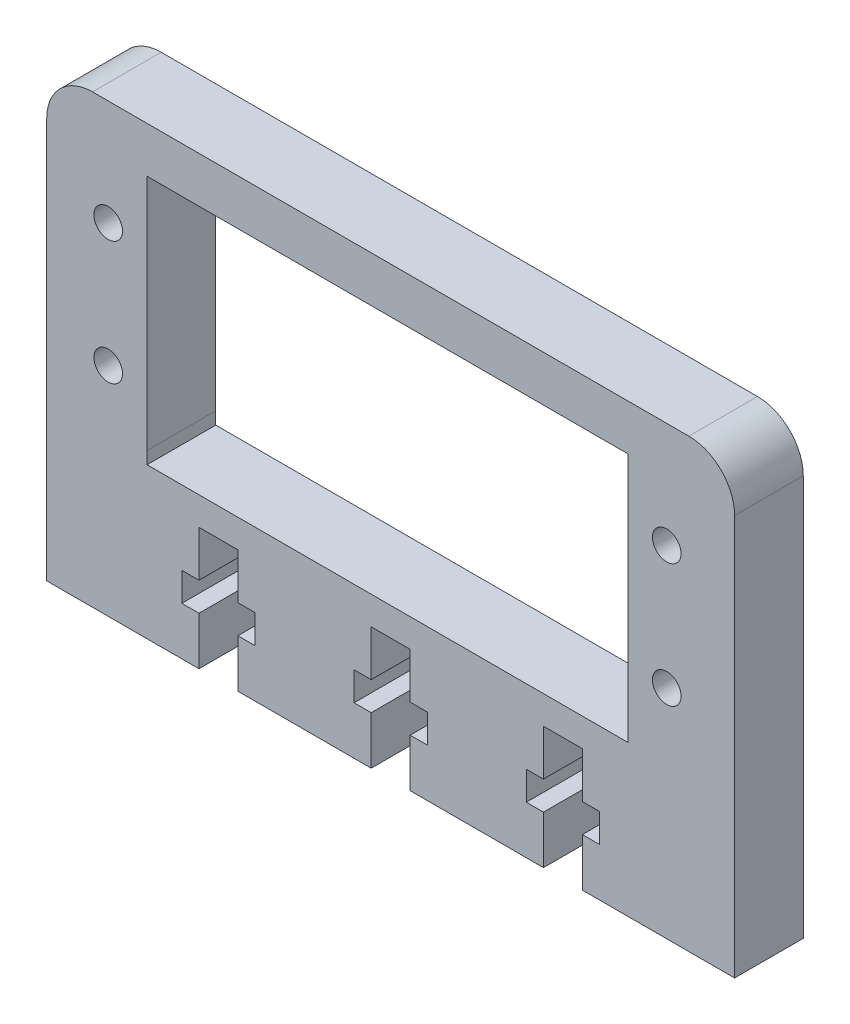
ISO-10303-21;
HEADER;
FILE_DESCRIPTION(('STEP AP214'),'2;1');
FILE_NAME('part.step','',(''),(''),'','','');
FILE_SCHEMA(('AUTOMOTIVE_DESIGN { 1 0 10303 214 1 1 1 1 }'));
ENDSEC;
DATA;
#1=APPLICATION_CONTEXT('core data for automotive mechanical design processes');
#2=APPLICATION_PROTOCOL_DEFINITION('international standard','automotive_design',2000,#1);
#3=PRODUCT_CONTEXT('',#1,'mechanical');
#4=PRODUCT('Part','Part','',(#3));
#5=PRODUCT_RELATED_PRODUCT_CATEGORY('part','',(#4));
#6=PRODUCT_DEFINITION_FORMATION('','',#4);
#7=PRODUCT_DEFINITION_CONTEXT('part definition',#1,'design');
#8=PRODUCT_DEFINITION('design','',#6,#7);
#9=PRODUCT_DEFINITION_SHAPE('','',#8);
#10=(LENGTH_UNIT() NAMED_UNIT(*) SI_UNIT(.MILLI.,.METRE.));
#11=(NAMED_UNIT(*) PLANE_ANGLE_UNIT() SI_UNIT($,.RADIAN.));
#12=(NAMED_UNIT(*) SI_UNIT($,.STERADIAN.) SOLID_ANGLE_UNIT());
#13=UNCERTAINTY_MEASURE_WITH_UNIT(LENGTH_MEASURE(1.E-05),#10,'distance_accuracy_value','');
#14=(GEOMETRIC_REPRESENTATION_CONTEXT(3) GLOBAL_UNCERTAINTY_ASSIGNED_CONTEXT((#13)) GLOBAL_UNIT_ASSIGNED_CONTEXT((#10,
#11,#12)) REPRESENTATION_CONTEXT('',''));
#15=CARTESIAN_POINT('',(0.,0.,0.));
#16=DIRECTION('',(0.,0.,1.));
#17=DIRECTION('',(1.,0.,0.));
#18=AXIS2_PLACEMENT_3D('',#15,#16,#17);
#19=CARTESIAN_POINT('',(-22.0578435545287,73.2085803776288,-6.));
#20=DIRECTION('',(-1.,0.,0.));
#21=DIRECTION('',(0.,-1.,0.));
#22=AXIS2_PLACEMENT_3D('',#19,#20,#21);
#23=PLANE('',#22);
#24=DIRECTION('',(0.,-1.,0.));
#25=VECTOR('',#24,1.);
#26=CARTESIAN_POINT('',(-22.0578435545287,73.2085803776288,0.));
#27=LINE('',#26,#25);
#28=CARTESIAN_POINT('',(-22.0578435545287,73.2085803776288,0.));
#29=VERTEX_POINT('',#28);
#30=CARTESIAN_POINT('',(-22.0578435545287,38.2085803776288,0.));
#31=VERTEX_POINT('',#30);
#32=EDGE_CURVE('E366',#29,#31,#27,.T.);
#33=ORIENTED_EDGE('',*,*,#32,.F.);
#34=DIRECTION('',(0.,0.,1.));
#35=VECTOR('',#34,1.);
#36=CARTESIAN_POINT('',(-22.0578435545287,73.2085803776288,-6.));
#37=LINE('',#36,#35);
#38=CARTESIAN_POINT('',(-22.0578435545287,73.2085803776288,-6.));
#39=VERTEX_POINT('',#38);
#40=EDGE_CURVE('E11',#39,#29,#37,.T.);
#41=ORIENTED_EDGE('',*,*,#40,.F.);
#42=DIRECTION('',(0.,-1.,0.));
#43=VECTOR('',#42,1.);
#44=CARTESIAN_POINT('',(-22.0578435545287,73.2085803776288,-6.));
#45=LINE('',#44,#43);
#46=CARTESIAN_POINT('',(-22.0578435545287,38.2085803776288,-6.));
#47=VERTEX_POINT('',#46);
#48=EDGE_CURVE('E367',#39,#47,#45,.T.);
#49=ORIENTED_EDGE('',*,*,#48,.T.);
#50=DIRECTION('',(0.,0.,1.));
#51=VECTOR('',#50,1.);
#52=CARTESIAN_POINT('',(-22.0578435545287,38.2085803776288,-6.));
#53=LINE('',#52,#51);
#54=EDGE_CURVE('E35',#47,#31,#53,.T.);
#55=ORIENTED_EDGE('',*,*,#54,.T.);
#56=EDGE_LOOP('',(#33,#41,#49,#55));
#57=FACE_BOUND('',#56,.T.);
#58=ADVANCED_FACE('F32',(#57),#23,.T.);
#59=CARTESIAN_POINT('',(-18.0578435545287,73.2085803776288,-6.));
#60=DIRECTION('',(0.,0.,1.));
#61=DIRECTION('',(1.,0.,0.));
#62=AXIS2_PLACEMENT_3D('',#59,#60,#61);
#63=CYLINDRICAL_SURFACE('',#62,4.);
#64=CARTESIAN_POINT('',(-18.0578435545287,73.2085803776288,0.));
#65=DIRECTION('',(0.,0.,1.));
#66=DIRECTION('',(-1.,0.,0.));
#67=AXIS2_PLACEMENT_3D('',#64,#65,#66);
#68=CIRCLE('',#67,4.);
#69=CARTESIAN_POINT('',(-18.0578435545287,77.2085803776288,0.));
#70=VERTEX_POINT('',#69);
#71=EDGE_CURVE('E371',#70,#29,#68,.T.);
#72=ORIENTED_EDGE('',*,*,#71,.F.);
#73=DIRECTION('',(0.,0.,1.));
#74=VECTOR('',#73,1.);
#75=CARTESIAN_POINT('',(-18.0578435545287,77.2085803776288,-6.));
#76=LINE('',#75,#74);
#77=CARTESIAN_POINT('',(-18.0578435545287,77.2085803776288,-6.));
#78=VERTEX_POINT('',#77);
#79=EDGE_CURVE('E40',#78,#70,#76,.T.);
#80=ORIENTED_EDGE('',*,*,#79,.F.);
#81=CARTESIAN_POINT('',(-18.0578435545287,73.2085803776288,-6.));
#82=DIRECTION('',(0.,0.,1.));
#83=DIRECTION('',(-1.,0.,0.));
#84=AXIS2_PLACEMENT_3D('',#81,#82,#83);
#85=CIRCLE('',#84,4.);
#86=EDGE_CURVE('E490',#78,#39,#85,.T.);
#87=ORIENTED_EDGE('',*,*,#86,.T.);
#88=ORIENTED_EDGE('',*,*,#40,.T.);
#89=EDGE_LOOP('',(#72,#80,#87,#88));
#90=FACE_BOUND('',#89,.T.);
#91=ADVANCED_FACE('F707',(#90),#63,.T.);
#92=CARTESIAN_POINT('',(34.03975457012,77.2085803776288,-6.));
#93=DIRECTION('',(0.,1.,0.));
#94=DIRECTION('',(0.,0.,1.));
#95=AXIS2_PLACEMENT_3D('',#92,#93,#94);
#96=PLANE('',#95);
#97=DIRECTION('',(-1.,0.,0.));
#98=VECTOR('',#97,1.);
#99=CARTESIAN_POINT('',(34.03975457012,77.2085803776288,-6.));
#100=LINE('',#99,#98);
#101=CARTESIAN_POINT('',(34.03975457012,77.2085803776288,-6.));
#102=VERTEX_POINT('',#101);
#103=EDGE_CURVE('E488',#102,#78,#100,.T.);
#104=ORIENTED_EDGE('',*,*,#103,.T.);
#105=ORIENTED_EDGE('',*,*,#79,.T.);
#106=DIRECTION('',(-1.,0.,0.));
#107=VECTOR('',#106,1.);
#108=CARTESIAN_POINT('',(34.03975457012,77.2085803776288,0.));
#109=LINE('',#108,#107);
#110=CARTESIAN_POINT('',(34.03975457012,77.2085803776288,0.));
#111=VERTEX_POINT('',#110);
#112=EDGE_CURVE('E612',#111,#70,#109,.T.);
#113=ORIENTED_EDGE('',*,*,#112,.F.);
#114=DIRECTION('',(0.,0.,1.));
#115=VECTOR('',#114,1.);
#116=CARTESIAN_POINT('',(34.03975457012,77.2085803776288,-6.));
#117=LINE('',#116,#115);
#118=EDGE_CURVE('E618',#102,#111,#117,.T.);
#119=ORIENTED_EDGE('',*,*,#118,.F.);
#120=EDGE_LOOP('',(#104,#105,#113,#119));
#121=FACE_BOUND('',#120,.T.);
#122=ADVANCED_FACE('F865',(#121),#96,.T.);
#123=CARTESIAN_POINT('',(34.03975457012,73.2085803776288,-6.));
#124=DIRECTION('',(0.,0.,1.));
#125=DIRECTION('',(1.,0.,0.));
#126=AXIS2_PLACEMENT_3D('',#123,#124,#125);
#127=CYLINDRICAL_SURFACE('',#126,4.);
#128=CARTESIAN_POINT('',(34.03975457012,73.2085803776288,0.));
#129=DIRECTION('',(0.,0.,1.));
#130=DIRECTION('',(-1.,0.,0.));
#131=AXIS2_PLACEMENT_3D('',#128,#129,#130);
#132=CIRCLE('',#131,4.);
#133=CARTESIAN_POINT('',(38.03975457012,73.2085803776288,0.));
#134=VERTEX_POINT('',#133);
#135=EDGE_CURVE('E609',#134,#111,#132,.T.);
#136=ORIENTED_EDGE('',*,*,#135,.F.);
#137=DIRECTION('',(0.,0.,1.));
#138=VECTOR('',#137,1.);
#139=CARTESIAN_POINT('',(38.03975457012,73.2085803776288,-6.));
#140=LINE('',#139,#138);
#141=CARTESIAN_POINT('',(38.03975457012,73.2085803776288,-6.));
#142=VERTEX_POINT('',#141);
#143=EDGE_CURVE('E620',#142,#134,#140,.T.);
#144=ORIENTED_EDGE('',*,*,#143,.F.);
#145=CARTESIAN_POINT('',(34.03975457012,73.2085803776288,-6.));
#146=DIRECTION('',(0.,0.,1.));
#147=DIRECTION('',(-1.,0.,0.));
#148=AXIS2_PLACEMENT_3D('',#145,#146,#147);
#149=CIRCLE('',#148,4.);
#150=EDGE_CURVE('E485',#142,#102,#149,.T.);
#151=ORIENTED_EDGE('',*,*,#150,.T.);
#152=ORIENTED_EDGE('',*,*,#118,.T.);
#153=EDGE_LOOP('',(#136,#144,#151,#152));
#154=FACE_BOUND('',#153,.T.);
#155=ADVANCED_FACE('F862',(#154),#127,.T.);
#156=CARTESIAN_POINT('',(38.03975457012,38.2085803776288,-6.));
#157=DIRECTION('',(1.,0.,0.));
#158=DIRECTION('',(0.,0.,-1.));
#159=AXIS2_PLACEMENT_3D('',#156,#157,#158);
#160=PLANE('',#159);
#161=DIRECTION('',(0.,1.,0.));
#162=VECTOR('',#161,1.);
#163=CARTESIAN_POINT('',(38.03975457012,38.2085803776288,0.));
#164=LINE('',#163,#162);
#165=CARTESIAN_POINT('',(38.03975457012,38.2085803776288,0.));
#166=VERTEX_POINT('',#165);
#167=EDGE_CURVE('E606',#166,#134,#164,.T.);
#168=ORIENTED_EDGE('',*,*,#167,.F.);
#169=DIRECTION('',(0.,0.,1.));
#170=VECTOR('',#169,1.);
#171=CARTESIAN_POINT('',(38.03975457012,38.2085803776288,-6.));
#172=LINE('',#171,#170);
#173=CARTESIAN_POINT('',(38.03975457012,38.2085803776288,-6.));
#174=VERTEX_POINT('',#173);
#175=EDGE_CURVE('E622',#174,#166,#172,.T.);
#176=ORIENTED_EDGE('',*,*,#175,.F.);
#177=DIRECTION('',(0.,1.,0.));
#178=VECTOR('',#177,1.);
#179=CARTESIAN_POINT('',(38.03975457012,38.2085803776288,-6.));
#180=LINE('',#179,#178);
#181=EDGE_CURVE('E482',#174,#142,#180,.T.);
#182=ORIENTED_EDGE('',*,*,#181,.T.);
#183=ORIENTED_EDGE('',*,*,#143,.T.);
#184=EDGE_LOOP('',(#168,#176,#182,#183));
#185=FACE_BOUND('',#184,.T.);
#186=ADVANCED_FACE('F859',(#185),#160,.T.);
#187=CARTESIAN_POINT('',(24.73975457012,38.2085803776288,-6.));
#188=DIRECTION('',(0.,-1.,0.));
#189=DIRECTION('',(0.,0.,-1.));
#190=AXIS2_PLACEMENT_3D('',#187,#188,#189);
#191=PLANE('',#190);
#192=DIRECTION('',(1.,0.,0.));
#193=VECTOR('',#192,1.);
#194=CARTESIAN_POINT('',(24.73975457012,38.2085803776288,0.));
#195=LINE('',#194,#193);
#196=CARTESIAN_POINT('',(24.73975457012,38.2085803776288,0.));
#197=VERTEX_POINT('',#196);
#198=EDGE_CURVE('E603',#197,#166,#195,.T.);
#199=ORIENTED_EDGE('',*,*,#198,.F.);
#200=DIRECTION('',(0.,0.,1.));
#201=VECTOR('',#200,1.);
#202=CARTESIAN_POINT('',(24.73975457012,38.2085803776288,-6.));
#203=LINE('',#202,#201);
#204=CARTESIAN_POINT('',(24.73975457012,38.2085803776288,-6.));
#205=VERTEX_POINT('',#204);
#206=EDGE_CURVE('E624',#205,#197,#203,.T.);
#207=ORIENTED_EDGE('',*,*,#206,.F.);
#208=DIRECTION('',(1.,0.,0.));
#209=VECTOR('',#208,1.);
#210=CARTESIAN_POINT('',(24.73975457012,38.2085803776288,-6.));
#211=LINE('',#210,#209);
#212=EDGE_CURVE('E479',#205,#174,#211,.T.);
#213=ORIENTED_EDGE('',*,*,#212,.T.);
#214=ORIENTED_EDGE('',*,*,#175,.T.);
#215=EDGE_LOOP('',(#199,#207,#213,#214));
#216=FACE_BOUND('',#215,.T.);
#217=ADVANCED_FACE('F855',(#216),#191,.T.);
#218=CARTESIAN_POINT('',(24.73975457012,38.2085803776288,-6.));
#219=DIRECTION('',(-1.,0.,0.));
#220=DIRECTION('',(0.,0.,1.));
#221=AXIS2_PLACEMENT_3D('',#218,#219,#220);
#222=PLANE('',#221);
#223=DIRECTION('',(0.,-1.,0.));
#224=VECTOR('',#223,1.);
#225=CARTESIAN_POINT('',(24.73975457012,38.2085803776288,0.));
#226=LINE('',#225,#224);
#227=CARTESIAN_POINT('',(24.73975457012,42.4085803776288,0.));
#228=VERTEX_POINT('',#227);
#229=EDGE_CURVE('E600',#228,#197,#226,.T.);
#230=ORIENTED_EDGE('',*,*,#229,.F.);
#231=DIRECTION('',(0.,0.,1.));
#232=VECTOR('',#231,1.);
#233=CARTESIAN_POINT('',(24.73975457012,42.4085803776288,-6.));
#234=LINE('',#233,#232);
#235=CARTESIAN_POINT('',(24.73975457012,42.4085803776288,-6.));
#236=VERTEX_POINT('',#235);
#237=EDGE_CURVE('E626',#236,#228,#234,.T.);
#238=ORIENTED_EDGE('',*,*,#237,.F.);
#239=DIRECTION('',(0.,-1.,0.));
#240=VECTOR('',#239,1.);
#241=CARTESIAN_POINT('',(24.73975457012,38.2085803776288,-6.));
#242=LINE('',#241,#240);
#243=EDGE_CURVE('E476',#236,#205,#242,.T.);
#244=ORIENTED_EDGE('',*,*,#243,.T.);
#245=ORIENTED_EDGE('',*,*,#206,.T.);
#246=EDGE_LOOP('',(#230,#238,#244,#245));
#247=FACE_BOUND('',#246,.T.);
#248=ADVANCED_FACE('F851',(#247),#222,.T.);
#249=CARTESIAN_POINT('',(24.73975457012,42.4085803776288,-6.));
#250=DIRECTION('',(0.,1.,0.));
#251=DIRECTION('',(0.,0.,1.));
#252=AXIS2_PLACEMENT_3D('',#249,#250,#251);
#253=PLANE('',#252);
#254=DIRECTION('',(-1.,0.,0.));
#255=VECTOR('',#254,1.);
#256=CARTESIAN_POINT('',(24.73975457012,42.4085803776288,0.));
#257=LINE('',#256,#255);
#258=CARTESIAN_POINT('',(26.23975457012,42.4085803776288,0.));
#259=VERTEX_POINT('',#258);
#260=EDGE_CURVE('E597',#259,#228,#257,.T.);
#261=ORIENTED_EDGE('',*,*,#260,.F.);
#262=DIRECTION('',(0.,0.,1.));
#263=VECTOR('',#262,1.);
#264=CARTESIAN_POINT('',(26.23975457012,42.4085803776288,-6.));
#265=LINE('',#264,#263);
#266=CARTESIAN_POINT('',(26.23975457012,42.4085803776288,-6.));
#267=VERTEX_POINT('',#266);
#268=EDGE_CURVE('E628',#267,#259,#265,.T.);
#269=ORIENTED_EDGE('',*,*,#268,.F.);
#270=DIRECTION('',(-1.,0.,0.));
#271=VECTOR('',#270,1.);
#272=CARTESIAN_POINT('',(24.73975457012,42.4085803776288,-6.));
#273=LINE('',#272,#271);
#274=EDGE_CURVE('E473',#267,#236,#273,.T.);
#275=ORIENTED_EDGE('',*,*,#274,.T.);
#276=ORIENTED_EDGE('',*,*,#237,.T.);
#277=EDGE_LOOP('',(#261,#269,#275,#276));
#278=FACE_BOUND('',#277,.T.);
#279=ADVANCED_FACE('F847',(#278),#253,.T.);
#280=CARTESIAN_POINT('',(26.23975457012,42.4085803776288,-6.));
#281=DIRECTION('',(-1.,0.,0.));
#282=DIRECTION('',(0.,0.,1.));
#283=AXIS2_PLACEMENT_3D('',#280,#281,#282);
#284=PLANE('',#283);
#285=DIRECTION('',(0.,-1.,0.));
#286=VECTOR('',#285,1.);
#287=CARTESIAN_POINT('',(26.23975457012,42.4085803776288,0.));
#288=LINE('',#287,#286);
#289=CARTESIAN_POINT('',(26.23975457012,44.9085803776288,0.));
#290=VERTEX_POINT('',#289);
#291=EDGE_CURVE('E594',#290,#259,#288,.T.);
#292=ORIENTED_EDGE('',*,*,#291,.F.);
#293=DIRECTION('',(0.,0.,1.));
#294=VECTOR('',#293,1.);
#295=CARTESIAN_POINT('',(26.23975457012,44.9085803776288,-6.));
#296=LINE('',#295,#294);
#297=CARTESIAN_POINT('',(26.23975457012,44.9085803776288,-6.));
#298=VERTEX_POINT('',#297);
#299=EDGE_CURVE('E630',#298,#290,#296,.T.);
#300=ORIENTED_EDGE('',*,*,#299,.F.);
#301=DIRECTION('',(0.,-1.,0.));
#302=VECTOR('',#301,1.);
#303=CARTESIAN_POINT('',(26.23975457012,42.4085803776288,-6.));
#304=LINE('',#303,#302);
#305=EDGE_CURVE('E470',#298,#267,#304,.T.);
#306=ORIENTED_EDGE('',*,*,#305,.T.);
#307=ORIENTED_EDGE('',*,*,#268,.T.);
#308=EDGE_LOOP('',(#292,#300,#306,#307));
#309=FACE_BOUND('',#308,.T.);
#310=ADVANCED_FACE('F843',(#309),#284,.T.);
#311=CARTESIAN_POINT('',(26.23975457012,44.9085803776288,-6.));
#312=DIRECTION('',(0.,-1.,0.));
#313=DIRECTION('',(0.,0.,-1.));
#314=AXIS2_PLACEMENT_3D('',#311,#312,#313);
#315=PLANE('',#314);
#316=DIRECTION('',(1.,0.,0.));
#317=VECTOR('',#316,1.);
#318=CARTESIAN_POINT('',(26.23975457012,44.9085803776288,0.));
#319=LINE('',#318,#317);
#320=CARTESIAN_POINT('',(24.73975457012,44.9085803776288,0.));
#321=VERTEX_POINT('',#320);
#322=EDGE_CURVE('E591',#321,#290,#319,.T.);
#323=ORIENTED_EDGE('',*,*,#322,.F.);
#324=DIRECTION('',(0.,0.,1.));
#325=VECTOR('',#324,1.);
#326=CARTESIAN_POINT('',(24.73975457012,44.9085803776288,-6.));
#327=LINE('',#326,#325);
#328=CARTESIAN_POINT('',(24.73975457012,44.9085803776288,-6.));
#329=VERTEX_POINT('',#328);
#330=EDGE_CURVE('E632',#329,#321,#327,.T.);
#331=ORIENTED_EDGE('',*,*,#330,.F.);
#332=DIRECTION('',(1.,0.,0.));
#333=VECTOR('',#332,1.);
#334=CARTESIAN_POINT('',(26.23975457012,44.9085803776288,-6.));
#335=LINE('',#334,#333);
#336=EDGE_CURVE('E467',#329,#298,#335,.T.);
#337=ORIENTED_EDGE('',*,*,#336,.T.);
#338=ORIENTED_EDGE('',*,*,#299,.T.);
#339=EDGE_LOOP('',(#323,#331,#337,#338));
#340=FACE_BOUND('',#339,.T.);
#341=ADVANCED_FACE('F839',(#340),#315,.T.);
#342=CARTESIAN_POINT('',(24.73975457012,44.9085803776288,-6.));
#343=DIRECTION('',(-1.,0.,0.));
#344=DIRECTION('',(0.,0.,1.));
#345=AXIS2_PLACEMENT_3D('',#342,#343,#344);
#346=PLANE('',#345);
#347=DIRECTION('',(0.,-1.,0.));
#348=VECTOR('',#347,1.);
#349=CARTESIAN_POINT('',(24.73975457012,44.9085803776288,0.));
#350=LINE('',#349,#348);
#351=CARTESIAN_POINT('',(24.73975457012,48.9085803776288,0.));
#352=VERTEX_POINT('',#351);
#353=EDGE_CURVE('E588',#352,#321,#350,.T.);
#354=ORIENTED_EDGE('',*,*,#353,.F.);
#355=DIRECTION('',(0.,0.,1.));
#356=VECTOR('',#355,1.);
#357=CARTESIAN_POINT('',(24.73975457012,48.9085803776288,-6.));
#358=LINE('',#357,#356);
#359=CARTESIAN_POINT('',(24.73975457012,48.9085803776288,-6.));
#360=VERTEX_POINT('',#359);
#361=EDGE_CURVE('E634',#360,#352,#358,.T.);
#362=ORIENTED_EDGE('',*,*,#361,.F.);
#363=DIRECTION('',(0.,-1.,0.));
#364=VECTOR('',#363,1.);
#365=CARTESIAN_POINT('',(24.73975457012,44.9085803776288,-6.));
#366=LINE('',#365,#364);
#367=EDGE_CURVE('E464',#360,#329,#366,.T.);
#368=ORIENTED_EDGE('',*,*,#367,.T.);
#369=ORIENTED_EDGE('',*,*,#330,.T.);
#370=EDGE_LOOP('',(#354,#362,#368,#369));
#371=FACE_BOUND('',#370,.T.);
#372=ADVANCED_FACE('F835',(#371),#346,.T.);
#373=CARTESIAN_POINT('',(24.73975457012,48.9085803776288,-6.));
#374=DIRECTION('',(0.,-1.,0.));
#375=DIRECTION('',(0.,0.,-1.));
#376=AXIS2_PLACEMENT_3D('',#373,#374,#375);
#377=PLANE('',#376);
#378=DIRECTION('',(1.,0.,0.));
#379=VECTOR('',#378,1.);
#380=CARTESIAN_POINT('',(24.73975457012,48.9085803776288,0.));
#381=LINE('',#380,#379);
#382=CARTESIAN_POINT('',(21.33975457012,48.9085803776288,0.));
#383=VERTEX_POINT('',#382);
#384=EDGE_CURVE('E585',#383,#352,#381,.T.);
#385=ORIENTED_EDGE('',*,*,#384,.F.);
#386=DIRECTION('',(0.,0.,1.));
#387=VECTOR('',#386,1.);
#388=CARTESIAN_POINT('',(21.33975457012,48.9085803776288,-6.));
#389=LINE('',#388,#387);
#390=CARTESIAN_POINT('',(21.33975457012,48.9085803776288,-6.));
#391=VERTEX_POINT('',#390);
#392=EDGE_CURVE('E636',#391,#383,#389,.T.);
#393=ORIENTED_EDGE('',*,*,#392,.F.);
#394=DIRECTION('',(1.,0.,0.));
#395=VECTOR('',#394,1.);
#396=CARTESIAN_POINT('',(24.73975457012,48.9085803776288,-6.));
#397=LINE('',#396,#395);
#398=EDGE_CURVE('E461',#391,#360,#397,.T.);
#399=ORIENTED_EDGE('',*,*,#398,.T.);
#400=ORIENTED_EDGE('',*,*,#361,.T.);
#401=EDGE_LOOP('',(#385,#393,#399,#400));
#402=FACE_BOUND('',#401,.T.);
#403=ADVANCED_FACE('F831',(#402),#377,.T.);
#404=CARTESIAN_POINT('',(21.33975457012,44.9085803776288,-6.));
#405=DIRECTION('',(1.,0.,0.));
#406=DIRECTION('',(0.,0.,-1.));
#407=AXIS2_PLACEMENT_3D('',#404,#405,#406);
#408=PLANE('',#407);
#409=DIRECTION('',(0.,1.,0.));
#410=VECTOR('',#409,1.);
#411=CARTESIAN_POINT('',(21.33975457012,44.9085803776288,0.));
#412=LINE('',#411,#410);
#413=CARTESIAN_POINT('',(21.33975457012,44.9085803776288,0.));
#414=VERTEX_POINT('',#413);
#415=EDGE_CURVE('E582',#414,#383,#412,.T.);
#416=ORIENTED_EDGE('',*,*,#415,.F.);
#417=DIRECTION('',(0.,0.,1.));
#418=VECTOR('',#417,1.);
#419=CARTESIAN_POINT('',(21.33975457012,44.9085803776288,-6.));
#420=LINE('',#419,#418);
#421=CARTESIAN_POINT('',(21.33975457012,44.9085803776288,-6.));
#422=VERTEX_POINT('',#421);
#423=EDGE_CURVE('E638',#422,#414,#420,.T.);
#424=ORIENTED_EDGE('',*,*,#423,.F.);
#425=DIRECTION('',(0.,1.,0.));
#426=VECTOR('',#425,1.);
#427=CARTESIAN_POINT('',(21.33975457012,44.9085803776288,-6.));
#428=LINE('',#427,#426);
#429=EDGE_CURVE('E458',#422,#391,#428,.T.);
#430=ORIENTED_EDGE('',*,*,#429,.T.);
#431=ORIENTED_EDGE('',*,*,#392,.T.);
#432=EDGE_LOOP('',(#416,#424,#430,#431));
#433=FACE_BOUND('',#432,.T.);
#434=ADVANCED_FACE('F827',(#433),#408,.T.);
#435=CARTESIAN_POINT('',(19.83975457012,44.9085803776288,-6.));
#436=DIRECTION('',(0.,-1.,0.));
#437=DIRECTION('',(0.,0.,-1.));
#438=AXIS2_PLACEMENT_3D('',#435,#436,#437);
#439=PLANE('',#438);
#440=DIRECTION('',(1.,0.,0.));
#441=VECTOR('',#440,1.);
#442=CARTESIAN_POINT('',(19.83975457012,44.9085803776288,0.));
#443=LINE('',#442,#441);
#444=CARTESIAN_POINT('',(19.83975457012,44.9085803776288,0.));
#445=VERTEX_POINT('',#444);
#446=EDGE_CURVE('E579',#445,#414,#443,.T.);
#447=ORIENTED_EDGE('',*,*,#446,.F.);
#448=DIRECTION('',(0.,0.,1.));
#449=VECTOR('',#448,1.);
#450=CARTESIAN_POINT('',(19.83975457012,44.9085803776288,-6.));
#451=LINE('',#450,#449);
#452=CARTESIAN_POINT('',(19.83975457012,44.9085803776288,-6.));
#453=VERTEX_POINT('',#452);
#454=EDGE_CURVE('E640',#453,#445,#451,.T.);
#455=ORIENTED_EDGE('',*,*,#454,.F.);
#456=DIRECTION('',(1.,0.,0.));
#457=VECTOR('',#456,1.);
#458=CARTESIAN_POINT('',(19.83975457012,44.9085803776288,-6.));
#459=LINE('',#458,#457);
#460=EDGE_CURVE('E455',#453,#422,#459,.T.);
#461=ORIENTED_EDGE('',*,*,#460,.T.);
#462=ORIENTED_EDGE('',*,*,#423,.T.);
#463=EDGE_LOOP('',(#447,#455,#461,#462));
#464=FACE_BOUND('',#463,.T.);
#465=ADVANCED_FACE('F823',(#464),#439,.T.);
#466=CARTESIAN_POINT('',(19.83975457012,42.4085803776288,-6.));
#467=DIRECTION('',(1.,0.,0.));
#468=DIRECTION('',(0.,0.,-1.));
#469=AXIS2_PLACEMENT_3D('',#466,#467,#468);
#470=PLANE('',#469);
#471=DIRECTION('',(0.,1.,0.));
#472=VECTOR('',#471,1.);
#473=CARTESIAN_POINT('',(19.83975457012,42.4085803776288,0.));
#474=LINE('',#473,#472);
#475=CARTESIAN_POINT('',(19.83975457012,42.4085803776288,0.));
#476=VERTEX_POINT('',#475);
#477=EDGE_CURVE('E576',#476,#445,#474,.T.);
#478=ORIENTED_EDGE('',*,*,#477,.F.);
#479=DIRECTION('',(0.,0.,1.));
#480=VECTOR('',#479,1.);
#481=CARTESIAN_POINT('',(19.83975457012,42.4085803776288,-6.));
#482=LINE('',#481,#480);
#483=CARTESIAN_POINT('',(19.83975457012,42.4085803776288,-6.));
#484=VERTEX_POINT('',#483);
#485=EDGE_CURVE('E642',#484,#476,#482,.T.);
#486=ORIENTED_EDGE('',*,*,#485,.F.);
#487=DIRECTION('',(0.,1.,0.));
#488=VECTOR('',#487,1.);
#489=CARTESIAN_POINT('',(19.83975457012,42.4085803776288,-6.));
#490=LINE('',#489,#488);
#491=EDGE_CURVE('E452',#484,#453,#490,.T.);
#492=ORIENTED_EDGE('',*,*,#491,.T.);
#493=ORIENTED_EDGE('',*,*,#454,.T.);
#494=EDGE_LOOP('',(#478,#486,#492,#493));
#495=FACE_BOUND('',#494,.T.);
#496=ADVANCED_FACE('F819',(#495),#470,.T.);
#497=CARTESIAN_POINT('',(21.33975457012,42.4085803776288,-6.));
#498=DIRECTION('',(0.,1.,0.));
#499=DIRECTION('',(0.,0.,1.));
#500=AXIS2_PLACEMENT_3D('',#497,#498,#499);
#501=PLANE('',#500);
#502=DIRECTION('',(-1.,0.,0.));
#503=VECTOR('',#502,1.);
#504=CARTESIAN_POINT('',(21.33975457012,42.4085803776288,0.));
#505=LINE('',#504,#503);
#506=CARTESIAN_POINT('',(21.33975457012,42.4085803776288,0.));
#507=VERTEX_POINT('',#506);
#508=EDGE_CURVE('E573',#507,#476,#505,.T.);
#509=ORIENTED_EDGE('',*,*,#508,.F.);
#510=DIRECTION('',(0.,0.,1.));
#511=VECTOR('',#510,1.);
#512=CARTESIAN_POINT('',(21.33975457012,42.4085803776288,-6.));
#513=LINE('',#512,#511);
#514=CARTESIAN_POINT('',(21.33975457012,42.4085803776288,-6.));
#515=VERTEX_POINT('',#514);
#516=EDGE_CURVE('E644',#515,#507,#513,.T.);
#517=ORIENTED_EDGE('',*,*,#516,.F.);
#518=DIRECTION('',(-1.,0.,0.));
#519=VECTOR('',#518,1.);
#520=CARTESIAN_POINT('',(21.33975457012,42.4085803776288,-6.));
#521=LINE('',#520,#519);
#522=EDGE_CURVE('E449',#515,#484,#521,.T.);
#523=ORIENTED_EDGE('',*,*,#522,.T.);
#524=ORIENTED_EDGE('',*,*,#485,.T.);
#525=EDGE_LOOP('',(#509,#517,#523,#524));
#526=FACE_BOUND('',#525,.T.);
#527=ADVANCED_FACE('F815',(#526),#501,.T.);
#528=CARTESIAN_POINT('',(21.33975457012,38.2085803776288,-6.));
#529=DIRECTION('',(1.,0.,0.));
#530=DIRECTION('',(0.,0.,-1.));
#531=AXIS2_PLACEMENT_3D('',#528,#529,#530);
#532=PLANE('',#531);
#533=DIRECTION('',(0.,1.,0.));
#534=VECTOR('',#533,1.);
#535=CARTESIAN_POINT('',(21.33975457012,38.2085803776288,0.));
#536=LINE('',#535,#534);
#537=CARTESIAN_POINT('',(21.33975457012,38.2085803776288,0.));
#538=VERTEX_POINT('',#537);
#539=EDGE_CURVE('E570',#538,#507,#536,.T.);
#540=ORIENTED_EDGE('',*,*,#539,.F.);
#541=DIRECTION('',(0.,0.,1.));
#542=VECTOR('',#541,1.);
#543=CARTESIAN_POINT('',(21.33975457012,38.2085803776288,-6.));
#544=LINE('',#543,#542);
#545=CARTESIAN_POINT('',(21.33975457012,38.2085803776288,-6.));
#546=VERTEX_POINT('',#545);
#547=EDGE_CURVE('E646',#546,#538,#544,.T.);
#548=ORIENTED_EDGE('',*,*,#547,.F.);
#549=DIRECTION('',(0.,1.,0.));
#550=VECTOR('',#549,1.);
#551=CARTESIAN_POINT('',(21.33975457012,38.2085803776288,-6.));
#552=LINE('',#551,#550);
#553=EDGE_CURVE('E446',#546,#515,#552,.T.);
#554=ORIENTED_EDGE('',*,*,#553,.T.);
#555=ORIENTED_EDGE('',*,*,#516,.T.);
#556=EDGE_LOOP('',(#540,#548,#554,#555));
#557=FACE_BOUND('',#556,.T.);
#558=ADVANCED_FACE('F811',(#557),#532,.T.);
#559=CARTESIAN_POINT('',(9.69095550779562,38.2085803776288,-6.));
#560=DIRECTION('',(0.,-1.,0.));
#561=DIRECTION('',(0.,0.,-1.));
#562=AXIS2_PLACEMENT_3D('',#559,#560,#561);
#563=PLANE('',#562);
#564=DIRECTION('',(1.,0.,0.));
#565=VECTOR('',#564,1.);
#566=CARTESIAN_POINT('',(9.69095550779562,38.2085803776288,0.));
#567=LINE('',#566,#565);
#568=CARTESIAN_POINT('',(9.69095550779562,38.2085803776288,0.));
#569=VERTEX_POINT('',#568);
#570=EDGE_CURVE('E567',#569,#538,#567,.T.);
#571=ORIENTED_EDGE('',*,*,#570,.F.);
#572=DIRECTION('',(0.,0.,1.));
#573=VECTOR('',#572,1.);
#574=CARTESIAN_POINT('',(9.69095550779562,38.2085803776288,-6.));
#575=LINE('',#574,#573);
#576=CARTESIAN_POINT('',(9.69095550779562,38.2085803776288,-6.));
#577=VERTEX_POINT('',#576);
#578=EDGE_CURVE('E648',#577,#569,#575,.T.);
#579=ORIENTED_EDGE('',*,*,#578,.F.);
#580=DIRECTION('',(1.,0.,0.));
#581=VECTOR('',#580,1.);
#582=CARTESIAN_POINT('',(9.69095550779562,38.2085803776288,-6.));
#583=LINE('',#582,#581);
#584=EDGE_CURVE('E443',#577,#546,#583,.T.);
#585=ORIENTED_EDGE('',*,*,#584,.T.);
#586=ORIENTED_EDGE('',*,*,#547,.T.);
#587=EDGE_LOOP('',(#571,#579,#585,#586));
#588=FACE_BOUND('',#587,.T.);
#589=ADVANCED_FACE('F807',(#588),#563,.T.);
#590=CARTESIAN_POINT('',(9.69095550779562,38.2085803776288,-6.));
#591=DIRECTION('',(-1.,0.,0.));
#592=DIRECTION('',(0.,0.,1.));
#593=AXIS2_PLACEMENT_3D('',#590,#591,#592);
#594=PLANE('',#593);
#595=DIRECTION('',(0.,-1.,0.));
#596=VECTOR('',#595,1.);
#597=CARTESIAN_POINT('',(9.69095550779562,38.2085803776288,0.));
#598=LINE('',#597,#596);
#599=CARTESIAN_POINT('',(9.69095550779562,42.4085803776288,0.));
#600=VERTEX_POINT('',#599);
#601=EDGE_CURVE('E564',#600,#569,#598,.T.);
#602=ORIENTED_EDGE('',*,*,#601,.F.);
#603=DIRECTION('',(0.,0.,1.));
#604=VECTOR('',#603,1.);
#605=CARTESIAN_POINT('',(9.69095550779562,42.4085803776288,-6.));
#606=LINE('',#605,#604);
#607=CARTESIAN_POINT('',(9.69095550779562,42.4085803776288,-6.));
#608=VERTEX_POINT('',#607);
#609=EDGE_CURVE('E650',#608,#600,#606,.T.);
#610=ORIENTED_EDGE('',*,*,#609,.F.);
#611=DIRECTION('',(0.,-1.,0.));
#612=VECTOR('',#611,1.);
#613=CARTESIAN_POINT('',(9.69095550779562,38.2085803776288,-6.));
#614=LINE('',#613,#612);
#615=EDGE_CURVE('E440',#608,#577,#614,.T.);
#616=ORIENTED_EDGE('',*,*,#615,.T.);
#617=ORIENTED_EDGE('',*,*,#578,.T.);
#618=EDGE_LOOP('',(#602,#610,#616,#617));
#619=FACE_BOUND('',#618,.T.);
#620=ADVANCED_FACE('F803',(#619),#594,.T.);
#621=CARTESIAN_POINT('',(9.69095550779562,42.4085803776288,-6.));
#622=DIRECTION('',(0.,1.,0.));
#623=DIRECTION('',(0.,0.,1.));
#624=AXIS2_PLACEMENT_3D('',#621,#622,#623);
#625=PLANE('',#624);
#626=DIRECTION('',(-1.,0.,0.));
#627=VECTOR('',#626,1.);
#628=CARTESIAN_POINT('',(9.69095550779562,42.4085803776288,0.));
#629=LINE('',#628,#627);
#630=CARTESIAN_POINT('',(11.1909555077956,42.4085803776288,0.));
#631=VERTEX_POINT('',#630);
#632=EDGE_CURVE('E561',#631,#600,#629,.T.);
#633=ORIENTED_EDGE('',*,*,#632,.F.);
#634=DIRECTION('',(0.,0.,1.));
#635=VECTOR('',#634,1.);
#636=CARTESIAN_POINT('',(11.1909555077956,42.4085803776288,-6.));
#637=LINE('',#636,#635);
#638=CARTESIAN_POINT('',(11.1909555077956,42.4085803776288,-6.));
#639=VERTEX_POINT('',#638);
#640=EDGE_CURVE('E652',#639,#631,#637,.T.);
#641=ORIENTED_EDGE('',*,*,#640,.F.);
#642=DIRECTION('',(-1.,0.,0.));
#643=VECTOR('',#642,1.);
#644=CARTESIAN_POINT('',(9.69095550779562,42.4085803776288,-6.));
#645=LINE('',#644,#643);
#646=EDGE_CURVE('E437',#639,#608,#645,.T.);
#647=ORIENTED_EDGE('',*,*,#646,.T.);
#648=ORIENTED_EDGE('',*,*,#609,.T.);
#649=EDGE_LOOP('',(#633,#641,#647,#648));
#650=FACE_BOUND('',#649,.T.);
#651=ADVANCED_FACE('F799',(#650),#625,.T.);
#652=CARTESIAN_POINT('',(11.1909555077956,42.4085803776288,-6.));
#653=DIRECTION('',(-1.,0.,0.));
#654=DIRECTION('',(0.,-1.,0.));
#655=AXIS2_PLACEMENT_3D('',#652,#653,#654);
#656=PLANE('',#655);
#657=DIRECTION('',(0.,-1.,0.));
#658=VECTOR('',#657,1.);
#659=CARTESIAN_POINT('',(11.1909555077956,42.4085803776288,0.));
#660=LINE('',#659,#658);
#661=CARTESIAN_POINT('',(11.1909555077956,44.9085803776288,0.));
#662=VERTEX_POINT('',#661);
#663=EDGE_CURVE('E558',#662,#631,#660,.T.);
#664=ORIENTED_EDGE('',*,*,#663,.F.);
#665=DIRECTION('',(0.,0.,1.));
#666=VECTOR('',#665,1.);
#667=CARTESIAN_POINT('',(11.1909555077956,44.9085803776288,-6.));
#668=LINE('',#667,#666);
#669=CARTESIAN_POINT('',(11.1909555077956,44.9085803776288,-6.));
#670=VERTEX_POINT('',#669);
#671=EDGE_CURVE('E654',#670,#662,#668,.T.);
#672=ORIENTED_EDGE('',*,*,#671,.F.);
#673=DIRECTION('',(0.,-1.,0.));
#674=VECTOR('',#673,1.);
#675=CARTESIAN_POINT('',(11.1909555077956,42.4085803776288,-6.));
#676=LINE('',#675,#674);
#677=EDGE_CURVE('E434',#670,#639,#676,.T.);
#678=ORIENTED_EDGE('',*,*,#677,.T.);
#679=ORIENTED_EDGE('',*,*,#640,.T.);
#680=EDGE_LOOP('',(#664,#672,#678,#679));
#681=FACE_BOUND('',#680,.T.);
#682=ADVANCED_FACE('F795',(#681),#656,.T.);
#683=CARTESIAN_POINT('',(11.1909555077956,44.9085803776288,-6.));
#684=DIRECTION('',(0.,-1.,0.));
#685=DIRECTION('',(0.,0.,-1.));
#686=AXIS2_PLACEMENT_3D('',#683,#684,#685);
#687=PLANE('',#686);
#688=DIRECTION('',(1.,0.,0.));
#689=VECTOR('',#688,1.);
#690=CARTESIAN_POINT('',(11.1909555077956,44.9085803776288,0.));
#691=LINE('',#690,#689);
#692=CARTESIAN_POINT('',(9.69095550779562,44.9085803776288,0.));
#693=VERTEX_POINT('',#692);
#694=EDGE_CURVE('E555',#693,#662,#691,.T.);
#695=ORIENTED_EDGE('',*,*,#694,.F.);
#696=DIRECTION('',(0.,0.,1.));
#697=VECTOR('',#696,1.);
#698=CARTESIAN_POINT('',(9.69095550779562,44.9085803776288,-6.));
#699=LINE('',#698,#697);
#700=CARTESIAN_POINT('',(9.69095550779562,44.9085803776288,-6.));
#701=VERTEX_POINT('',#700);
#702=EDGE_CURVE('E656',#701,#693,#699,.T.);
#703=ORIENTED_EDGE('',*,*,#702,.F.);
#704=DIRECTION('',(1.,0.,0.));
#705=VECTOR('',#704,1.);
#706=CARTESIAN_POINT('',(11.1909555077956,44.9085803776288,-6.));
#707=LINE('',#706,#705);
#708=EDGE_CURVE('E431',#701,#670,#707,.T.);
#709=ORIENTED_EDGE('',*,*,#708,.T.);
#710=ORIENTED_EDGE('',*,*,#671,.T.);
#711=EDGE_LOOP('',(#695,#703,#709,#710));
#712=FACE_BOUND('',#711,.T.);
#713=ADVANCED_FACE('F791',(#712),#687,.T.);
#714=CARTESIAN_POINT('',(9.69095550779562,44.9085803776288,-6.));
#715=DIRECTION('',(-1.,0.,0.));
#716=DIRECTION('',(0.,0.,1.));
#717=AXIS2_PLACEMENT_3D('',#714,#715,#716);
#718=PLANE('',#717);
#719=DIRECTION('',(0.,-1.,0.));
#720=VECTOR('',#719,1.);
#721=CARTESIAN_POINT('',(9.69095550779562,44.9085803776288,0.));
#722=LINE('',#721,#720);
#723=CARTESIAN_POINT('',(9.69095550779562,48.9085803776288,0.));
#724=VERTEX_POINT('',#723);
#725=EDGE_CURVE('E552',#724,#693,#722,.T.);
#726=ORIENTED_EDGE('',*,*,#725,.F.);
#727=DIRECTION('',(0.,0.,1.));
#728=VECTOR('',#727,1.);
#729=CARTESIAN_POINT('',(9.69095550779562,48.9085803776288,-6.));
#730=LINE('',#729,#728);
#731=CARTESIAN_POINT('',(9.69095550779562,48.9085803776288,-6.));
#732=VERTEX_POINT('',#731);
#733=EDGE_CURVE('E658',#732,#724,#730,.T.);
#734=ORIENTED_EDGE('',*,*,#733,.F.);
#735=DIRECTION('',(0.,-1.,0.));
#736=VECTOR('',#735,1.);
#737=CARTESIAN_POINT('',(9.69095550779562,44.9085803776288,-6.));
#738=LINE('',#737,#736);
#739=EDGE_CURVE('E428',#732,#701,#738,.T.);
#740=ORIENTED_EDGE('',*,*,#739,.T.);
#741=ORIENTED_EDGE('',*,*,#702,.T.);
#742=EDGE_LOOP('',(#726,#734,#740,#741));
#743=FACE_BOUND('',#742,.T.);
#744=ADVANCED_FACE('F787',(#743),#718,.T.);
#745=CARTESIAN_POINT('',(9.69095550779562,48.9085803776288,-6.));
#746=DIRECTION('',(0.,-1.,0.));
#747=DIRECTION('',(0.,0.,-1.));
#748=AXIS2_PLACEMENT_3D('',#745,#746,#747);
#749=PLANE('',#748);
#750=DIRECTION('',(1.,0.,0.));
#751=VECTOR('',#750,1.);
#752=CARTESIAN_POINT('',(9.69095550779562,48.9085803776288,0.));
#753=LINE('',#752,#751);
#754=CARTESIAN_POINT('',(6.29095550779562,48.9085803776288,0.));
#755=VERTEX_POINT('',#754);
#756=EDGE_CURVE('E549',#755,#724,#753,.T.);
#757=ORIENTED_EDGE('',*,*,#756,.F.);
#758=DIRECTION('',(0.,0.,1.));
#759=VECTOR('',#758,1.);
#760=CARTESIAN_POINT('',(6.29095550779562,48.9085803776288,-6.));
#761=LINE('',#760,#759);
#762=CARTESIAN_POINT('',(6.29095550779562,48.9085803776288,-6.));
#763=VERTEX_POINT('',#762);
#764=EDGE_CURVE('E660',#763,#755,#761,.T.);
#765=ORIENTED_EDGE('',*,*,#764,.F.);
#766=DIRECTION('',(1.,0.,0.));
#767=VECTOR('',#766,1.);
#768=CARTESIAN_POINT('',(9.69095550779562,48.9085803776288,-6.));
#769=LINE('',#768,#767);
#770=EDGE_CURVE('E425',#763,#732,#769,.T.);
#771=ORIENTED_EDGE('',*,*,#770,.T.);
#772=ORIENTED_EDGE('',*,*,#733,.T.);
#773=EDGE_LOOP('',(#757,#765,#771,#772));
#774=FACE_BOUND('',#773,.T.);
#775=ADVANCED_FACE('F783',(#774),#749,.T.);
#776=CARTESIAN_POINT('',(6.29095550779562,44.9085803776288,-6.));
#777=DIRECTION('',(1.,0.,0.));
#778=DIRECTION('',(0.,0.,-1.));
#779=AXIS2_PLACEMENT_3D('',#776,#777,#778);
#780=PLANE('',#779);
#781=DIRECTION('',(0.,1.,0.));
#782=VECTOR('',#781,1.);
#783=CARTESIAN_POINT('',(6.29095550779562,44.9085803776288,0.));
#784=LINE('',#783,#782);
#785=CARTESIAN_POINT('',(6.29095550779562,44.9085803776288,0.));
#786=VERTEX_POINT('',#785);
#787=EDGE_CURVE('E546',#786,#755,#784,.T.);
#788=ORIENTED_EDGE('',*,*,#787,.F.);
#789=DIRECTION('',(0.,0.,1.));
#790=VECTOR('',#789,1.);
#791=CARTESIAN_POINT('',(6.29095550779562,44.9085803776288,-6.));
#792=LINE('',#791,#790);
#793=CARTESIAN_POINT('',(6.29095550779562,44.9085803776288,-6.));
#794=VERTEX_POINT('',#793);
#795=EDGE_CURVE('E662',#794,#786,#792,.T.);
#796=ORIENTED_EDGE('',*,*,#795,.F.);
#797=DIRECTION('',(0.,1.,0.));
#798=VECTOR('',#797,1.);
#799=CARTESIAN_POINT('',(6.29095550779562,44.9085803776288,-6.));
#800=LINE('',#799,#798);
#801=EDGE_CURVE('E422',#794,#763,#800,.T.);
#802=ORIENTED_EDGE('',*,*,#801,.T.);
#803=ORIENTED_EDGE('',*,*,#764,.T.);
#804=EDGE_LOOP('',(#788,#796,#802,#803));
#805=FACE_BOUND('',#804,.T.);
#806=ADVANCED_FACE('F779',(#805),#780,.T.);
#807=CARTESIAN_POINT('',(4.79095550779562,44.9085803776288,-6.));
#808=DIRECTION('',(0.,-1.,0.));
#809=DIRECTION('',(0.,0.,-1.));
#810=AXIS2_PLACEMENT_3D('',#807,#808,#809);
#811=PLANE('',#810);
#812=DIRECTION('',(1.,0.,0.));
#813=VECTOR('',#812,1.);
#814=CARTESIAN_POINT('',(4.79095550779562,44.9085803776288,0.));
#815=LINE('',#814,#813);
#816=CARTESIAN_POINT('',(4.79095550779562,44.9085803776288,0.));
#817=VERTEX_POINT('',#816);
#818=EDGE_CURVE('E543',#817,#786,#815,.T.);
#819=ORIENTED_EDGE('',*,*,#818,.F.);
#820=DIRECTION('',(0.,0.,1.));
#821=VECTOR('',#820,1.);
#822=CARTESIAN_POINT('',(4.79095550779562,44.9085803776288,-6.));
#823=LINE('',#822,#821);
#824=CARTESIAN_POINT('',(4.79095550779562,44.9085803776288,-6.));
#825=VERTEX_POINT('',#824);
#826=EDGE_CURVE('E664',#825,#817,#823,.T.);
#827=ORIENTED_EDGE('',*,*,#826,.F.);
#828=DIRECTION('',(1.,0.,0.));
#829=VECTOR('',#828,1.);
#830=CARTESIAN_POINT('',(4.79095550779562,44.9085803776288,-6.));
#831=LINE('',#830,#829);
#832=EDGE_CURVE('E419',#825,#794,#831,.T.);
#833=ORIENTED_EDGE('',*,*,#832,.T.);
#834=ORIENTED_EDGE('',*,*,#795,.T.);
#835=EDGE_LOOP('',(#819,#827,#833,#834));
#836=FACE_BOUND('',#835,.T.);
#837=ADVANCED_FACE('F775',(#836),#811,.T.);
#838=CARTESIAN_POINT('',(4.79095550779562,42.4085803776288,-6.));
#839=DIRECTION('',(1.,0.,0.));
#840=DIRECTION('',(0.,1.,0.));
#841=AXIS2_PLACEMENT_3D('',#838,#839,#840);
#842=PLANE('',#841);
#843=DIRECTION('',(0.,1.,0.));
#844=VECTOR('',#843,1.);
#845=CARTESIAN_POINT('',(4.79095550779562,42.4085803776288,0.));
#846=LINE('',#845,#844);
#847=CARTESIAN_POINT('',(4.79095550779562,42.4085803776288,0.));
#848=VERTEX_POINT('',#847);
#849=EDGE_CURVE('E540',#848,#817,#846,.T.);
#850=ORIENTED_EDGE('',*,*,#849,.F.);
#851=DIRECTION('',(0.,0.,1.));
#852=VECTOR('',#851,1.);
#853=CARTESIAN_POINT('',(4.79095550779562,42.4085803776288,-6.));
#854=LINE('',#853,#852);
#855=CARTESIAN_POINT('',(4.79095550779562,42.4085803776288,-6.));
#856=VERTEX_POINT('',#855);
#857=EDGE_CURVE('E666',#856,#848,#854,.T.);
#858=ORIENTED_EDGE('',*,*,#857,.F.);
#859=DIRECTION('',(0.,1.,0.));
#860=VECTOR('',#859,1.);
#861=CARTESIAN_POINT('',(4.79095550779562,42.4085803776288,-6.));
#862=LINE('',#861,#860);
#863=EDGE_CURVE('E416',#856,#825,#862,.T.);
#864=ORIENTED_EDGE('',*,*,#863,.T.);
#865=ORIENTED_EDGE('',*,*,#826,.T.);
#866=EDGE_LOOP('',(#850,#858,#864,#865));
#867=FACE_BOUND('',#866,.T.);
#868=ADVANCED_FACE('F771',(#867),#842,.T.);
#869=CARTESIAN_POINT('',(6.29095550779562,42.4085803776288,-6.));
#870=DIRECTION('',(0.,1.,0.));
#871=DIRECTION('',(0.,0.,1.));
#872=AXIS2_PLACEMENT_3D('',#869,#870,#871);
#873=PLANE('',#872);
#874=DIRECTION('',(-1.,0.,0.));
#875=VECTOR('',#874,1.);
#876=CARTESIAN_POINT('',(6.29095550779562,42.4085803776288,0.));
#877=LINE('',#876,#875);
#878=CARTESIAN_POINT('',(6.29095550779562,42.4085803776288,0.));
#879=VERTEX_POINT('',#878);
#880=EDGE_CURVE('E537',#879,#848,#877,.T.);
#881=ORIENTED_EDGE('',*,*,#880,.F.);
#882=DIRECTION('',(0.,0.,1.));
#883=VECTOR('',#882,1.);
#884=CARTESIAN_POINT('',(6.29095550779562,42.4085803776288,-6.));
#885=LINE('',#884,#883);
#886=CARTESIAN_POINT('',(6.29095550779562,42.4085803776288,-6.));
#887=VERTEX_POINT('',#886);
#888=EDGE_CURVE('E668',#887,#879,#885,.T.);
#889=ORIENTED_EDGE('',*,*,#888,.F.);
#890=DIRECTION('',(-1.,0.,0.));
#891=VECTOR('',#890,1.);
#892=CARTESIAN_POINT('',(6.29095550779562,42.4085803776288,-6.));
#893=LINE('',#892,#891);
#894=EDGE_CURVE('E413',#887,#856,#893,.T.);
#895=ORIENTED_EDGE('',*,*,#894,.T.);
#896=ORIENTED_EDGE('',*,*,#857,.T.);
#897=EDGE_LOOP('',(#881,#889,#895,#896));
#898=FACE_BOUND('',#897,.T.);
#899=ADVANCED_FACE('F767',(#898),#873,.T.);
#900=CARTESIAN_POINT('',(6.29095550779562,38.2085803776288,-6.));
#901=DIRECTION('',(1.,0.,0.));
#902=DIRECTION('',(0.,0.,-1.));
#903=AXIS2_PLACEMENT_3D('',#900,#901,#902);
#904=PLANE('',#903);
#905=DIRECTION('',(0.,1.,0.));
#906=VECTOR('',#905,1.);
#907=CARTESIAN_POINT('',(6.29095550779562,38.2085803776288,0.));
#908=LINE('',#907,#906);
#909=CARTESIAN_POINT('',(6.29095550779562,38.2085803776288,0.));
#910=VERTEX_POINT('',#909);
#911=EDGE_CURVE('E534',#910,#879,#908,.T.);
#912=ORIENTED_EDGE('',*,*,#911,.F.);
#913=DIRECTION('',(0.,0.,1.));
#914=VECTOR('',#913,1.);
#915=CARTESIAN_POINT('',(6.29095550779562,38.2085803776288,-6.));
#916=LINE('',#915,#914);
#917=CARTESIAN_POINT('',(6.29095550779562,38.2085803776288,-6.));
#918=VERTEX_POINT('',#917);
#919=EDGE_CURVE('E670',#918,#910,#916,.T.);
#920=ORIENTED_EDGE('',*,*,#919,.F.);
#921=DIRECTION('',(0.,1.,0.));
#922=VECTOR('',#921,1.);
#923=CARTESIAN_POINT('',(6.29095550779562,38.2085803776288,-6.));
#924=LINE('',#923,#922);
#925=EDGE_CURVE('E410',#918,#887,#924,.T.);
#926=ORIENTED_EDGE('',*,*,#925,.T.);
#927=ORIENTED_EDGE('',*,*,#888,.T.);
#928=EDGE_LOOP('',(#912,#920,#926,#927));
#929=FACE_BOUND('',#928,.T.);
#930=ADVANCED_FACE('F763',(#929),#904,.T.);
#931=CARTESIAN_POINT('',(-5.35784355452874,38.2085803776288,-6.));
#932=DIRECTION('',(0.,-1.,0.));
#933=DIRECTION('',(0.,0.,-1.));
#934=AXIS2_PLACEMENT_3D('',#931,#932,#933);
#935=PLANE('',#934);
#936=DIRECTION('',(1.,0.,0.));
#937=VECTOR('',#936,1.);
#938=CARTESIAN_POINT('',(-5.35784355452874,38.2085803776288,0.));
#939=LINE('',#938,#937);
#940=CARTESIAN_POINT('',(-5.35784355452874,38.2085803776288,0.));
#941=VERTEX_POINT('',#940);
#942=EDGE_CURVE('E531',#941,#910,#939,.T.);
#943=ORIENTED_EDGE('',*,*,#942,.F.);
#944=DIRECTION('',(0.,0.,1.));
#945=VECTOR('',#944,1.);
#946=CARTESIAN_POINT('',(-5.35784355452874,38.2085803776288,-6.));
#947=LINE('',#946,#945);
#948=CARTESIAN_POINT('',(-5.35784355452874,38.2085803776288,-6.));
#949=VERTEX_POINT('',#948);
#950=EDGE_CURVE('E672',#949,#941,#947,.T.);
#951=ORIENTED_EDGE('',*,*,#950,.F.);
#952=DIRECTION('',(1.,0.,0.));
#953=VECTOR('',#952,1.);
#954=CARTESIAN_POINT('',(-5.35784355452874,38.2085803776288,-6.));
#955=LINE('',#954,#953);
#956=EDGE_CURVE('E407',#949,#918,#955,.T.);
#957=ORIENTED_EDGE('',*,*,#956,.T.);
#958=ORIENTED_EDGE('',*,*,#919,.T.);
#959=EDGE_LOOP('',(#943,#951,#957,#958));
#960=FACE_BOUND('',#959,.T.);
#961=ADVANCED_FACE('F759',(#960),#935,.T.);
#962=CARTESIAN_POINT('',(-5.35784355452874,38.2085803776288,-6.));
#963=DIRECTION('',(-1.,0.,0.));
#964=DIRECTION('',(0.,0.,1.));
#965=AXIS2_PLACEMENT_3D('',#962,#963,#964);
#966=PLANE('',#965);
#967=DIRECTION('',(0.,-1.,0.));
#968=VECTOR('',#967,1.);
#969=CARTESIAN_POINT('',(-5.35784355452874,38.2085803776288,0.));
#970=LINE('',#969,#968);
#971=CARTESIAN_POINT('',(-5.35784355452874,42.4085803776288,0.));
#972=VERTEX_POINT('',#971);
#973=EDGE_CURVE('E528',#972,#941,#970,.T.);
#974=ORIENTED_EDGE('',*,*,#973,.F.);
#975=DIRECTION('',(0.,0.,1.));
#976=VECTOR('',#975,1.);
#977=CARTESIAN_POINT('',(-5.35784355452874,42.4085803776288,-6.));
#978=LINE('',#977,#976);
#979=CARTESIAN_POINT('',(-5.35784355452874,42.4085803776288,-6.));
#980=VERTEX_POINT('',#979);
#981=EDGE_CURVE('E674',#980,#972,#978,.T.);
#982=ORIENTED_EDGE('',*,*,#981,.F.);
#983=DIRECTION('',(0.,-1.,0.));
#984=VECTOR('',#983,1.);
#985=CARTESIAN_POINT('',(-5.35784355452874,38.2085803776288,-6.));
#986=LINE('',#985,#984);
#987=EDGE_CURVE('E404',#980,#949,#986,.T.);
#988=ORIENTED_EDGE('',*,*,#987,.T.);
#989=ORIENTED_EDGE('',*,*,#950,.T.);
#990=EDGE_LOOP('',(#974,#982,#988,#989));
#991=FACE_BOUND('',#990,.T.);
#992=ADVANCED_FACE('F755',(#991),#966,.T.);
#993=CARTESIAN_POINT('',(-5.35784355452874,42.4085803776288,-6.));
#994=DIRECTION('',(0.,1.,0.));
#995=DIRECTION('',(0.,0.,1.));
#996=AXIS2_PLACEMENT_3D('',#993,#994,#995);
#997=PLANE('',#996);
#998=DIRECTION('',(-1.,0.,0.));
#999=VECTOR('',#998,1.);
#1000=CARTESIAN_POINT('',(-5.35784355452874,42.4085803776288,0.));
#1001=LINE('',#1000,#999);
#1002=CARTESIAN_POINT('',(-3.85784355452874,42.4085803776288,0.));
#1003=VERTEX_POINT('',#1002);
#1004=EDGE_CURVE('E525',#1003,#972,#1001,.T.);
#1005=ORIENTED_EDGE('',*,*,#1004,.F.);
#1006=DIRECTION('',(0.,0.,1.));
#1007=VECTOR('',#1006,1.);
#1008=CARTESIAN_POINT('',(-3.85784355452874,42.4085803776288,-6.));
#1009=LINE('',#1008,#1007);
#1010=CARTESIAN_POINT('',(-3.85784355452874,42.4085803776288,-6.));
#1011=VERTEX_POINT('',#1010);
#1012=EDGE_CURVE('E676',#1011,#1003,#1009,.T.);
#1013=ORIENTED_EDGE('',*,*,#1012,.F.);
#1014=DIRECTION('',(-1.,0.,0.));
#1015=VECTOR('',#1014,1.);
#1016=CARTESIAN_POINT('',(-5.35784355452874,42.4085803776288,-6.));
#1017=LINE('',#1016,#1015);
#1018=EDGE_CURVE('E401',#1011,#980,#1017,.T.);
#1019=ORIENTED_EDGE('',*,*,#1018,.T.);
#1020=ORIENTED_EDGE('',*,*,#981,.T.);
#1021=EDGE_LOOP('',(#1005,#1013,#1019,#1020));
#1022=FACE_BOUND('',#1021,.T.);
#1023=ADVANCED_FACE('F751',(#1022),#997,.T.);
#1024=CARTESIAN_POINT('',(-3.85784355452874,42.4085803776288,-6.));
#1025=DIRECTION('',(-1.,0.,0.));
#1026=DIRECTION('',(0.,0.,1.));
#1027=AXIS2_PLACEMENT_3D('',#1024,#1025,#1026);
#1028=PLANE('',#1027);
#1029=DIRECTION('',(0.,-1.,0.));
#1030=VECTOR('',#1029,1.);
#1031=CARTESIAN_POINT('',(-3.85784355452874,42.4085803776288,0.));
#1032=LINE('',#1031,#1030);
#1033=CARTESIAN_POINT('',(-3.85784355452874,44.9085803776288,0.));
#1034=VERTEX_POINT('',#1033);
#1035=EDGE_CURVE('E522',#1034,#1003,#1032,.T.);
#1036=ORIENTED_EDGE('',*,*,#1035,.F.);
#1037=DIRECTION('',(0.,0.,1.));
#1038=VECTOR('',#1037,1.);
#1039=CARTESIAN_POINT('',(-3.85784355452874,44.9085803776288,-6.));
#1040=LINE('',#1039,#1038);
#1041=CARTESIAN_POINT('',(-3.85784355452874,44.9085803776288,-6.));
#1042=VERTEX_POINT('',#1041);
#1043=EDGE_CURVE('E678',#1042,#1034,#1040,.T.);
#1044=ORIENTED_EDGE('',*,*,#1043,.F.);
#1045=DIRECTION('',(0.,-1.,0.));
#1046=VECTOR('',#1045,1.);
#1047=CARTESIAN_POINT('',(-3.85784355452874,42.4085803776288,-6.));
#1048=LINE('',#1047,#1046);
#1049=EDGE_CURVE('E398',#1042,#1011,#1048,.T.);
#1050=ORIENTED_EDGE('',*,*,#1049,.T.);
#1051=ORIENTED_EDGE('',*,*,#1012,.T.);
#1052=EDGE_LOOP('',(#1036,#1044,#1050,#1051));
#1053=FACE_BOUND('',#1052,.T.);
#1054=ADVANCED_FACE('F747',(#1053),#1028,.T.);
#1055=CARTESIAN_POINT('',(-3.85784355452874,44.9085803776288,-6.));
#1056=DIRECTION('',(0.,-1.,0.));
#1057=DIRECTION('',(0.,0.,-1.));
#1058=AXIS2_PLACEMENT_3D('',#1055,#1056,#1057);
#1059=PLANE('',#1058);
#1060=DIRECTION('',(1.,0.,0.));
#1061=VECTOR('',#1060,1.);
#1062=CARTESIAN_POINT('',(-3.85784355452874,44.9085803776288,0.));
#1063=LINE('',#1062,#1061);
#1064=CARTESIAN_POINT('',(-5.35784355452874,44.9085803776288,0.));
#1065=VERTEX_POINT('',#1064);
#1066=EDGE_CURVE('E519',#1065,#1034,#1063,.T.);
#1067=ORIENTED_EDGE('',*,*,#1066,.F.);
#1068=DIRECTION('',(0.,0.,1.));
#1069=VECTOR('',#1068,1.);
#1070=CARTESIAN_POINT('',(-5.35784355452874,44.9085803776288,-6.));
#1071=LINE('',#1070,#1069);
#1072=CARTESIAN_POINT('',(-5.35784355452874,44.9085803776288,-6.));
#1073=VERTEX_POINT('',#1072);
#1074=EDGE_CURVE('E680',#1073,#1065,#1071,.T.);
#1075=ORIENTED_EDGE('',*,*,#1074,.F.);
#1076=DIRECTION('',(1.,0.,0.));
#1077=VECTOR('',#1076,1.);
#1078=CARTESIAN_POINT('',(-3.85784355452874,44.9085803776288,-6.));
#1079=LINE('',#1078,#1077);
#1080=EDGE_CURVE('E395',#1073,#1042,#1079,.T.);
#1081=ORIENTED_EDGE('',*,*,#1080,.T.);
#1082=ORIENTED_EDGE('',*,*,#1043,.T.);
#1083=EDGE_LOOP('',(#1067,#1075,#1081,#1082));
#1084=FACE_BOUND('',#1083,.T.);
#1085=ADVANCED_FACE('F743',(#1084),#1059,.T.);
#1086=CARTESIAN_POINT('',(-5.35784355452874,44.9085803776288,-6.));
#1087=DIRECTION('',(-1.,0.,0.));
#1088=DIRECTION('',(0.,0.,1.));
#1089=AXIS2_PLACEMENT_3D('',#1086,#1087,#1088);
#1090=PLANE('',#1089);
#1091=DIRECTION('',(0.,-1.,0.));
#1092=VECTOR('',#1091,1.);
#1093=CARTESIAN_POINT('',(-5.35784355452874,44.9085803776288,0.));
#1094=LINE('',#1093,#1092);
#1095=CARTESIAN_POINT('',(-5.35784355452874,48.9085803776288,0.));
#1096=VERTEX_POINT('',#1095);
#1097=EDGE_CURVE('E516',#1096,#1065,#1094,.T.);
#1098=ORIENTED_EDGE('',*,*,#1097,.F.);
#1099=DIRECTION('',(0.,0.,1.));
#1100=VECTOR('',#1099,1.);
#1101=CARTESIAN_POINT('',(-5.35784355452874,48.9085803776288,-6.));
#1102=LINE('',#1101,#1100);
#1103=CARTESIAN_POINT('',(-5.35784355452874,48.9085803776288,-6.));
#1104=VERTEX_POINT('',#1103);
#1105=EDGE_CURVE('E682',#1104,#1096,#1102,.T.);
#1106=ORIENTED_EDGE('',*,*,#1105,.F.);
#1107=DIRECTION('',(0.,-1.,0.));
#1108=VECTOR('',#1107,1.);
#1109=CARTESIAN_POINT('',(-5.35784355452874,44.9085803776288,-6.));
#1110=LINE('',#1109,#1108);
#1111=EDGE_CURVE('E392',#1104,#1073,#1110,.T.);
#1112=ORIENTED_EDGE('',*,*,#1111,.T.);
#1113=ORIENTED_EDGE('',*,*,#1074,.T.);
#1114=EDGE_LOOP('',(#1098,#1106,#1112,#1113));
#1115=FACE_BOUND('',#1114,.T.);
#1116=ADVANCED_FACE('F739',(#1115),#1090,.T.);
#1117=CARTESIAN_POINT('',(-8.75784355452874,48.9085803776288,-6.));
#1118=DIRECTION('',(0.,-1.,0.));
#1119=DIRECTION('',(0.,0.,-1.));
#1120=AXIS2_PLACEMENT_3D('',#1117,#1118,#1119);
#1121=PLANE('',#1120);
#1122=DIRECTION('',(1.,0.,0.));
#1123=VECTOR('',#1122,1.);
#1124=CARTESIAN_POINT('',(-8.75784355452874,48.9085803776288,0.));
#1125=LINE('',#1124,#1123);
#1126=CARTESIAN_POINT('',(-8.75784355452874,48.9085803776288,0.));
#1127=VERTEX_POINT('',#1126);
#1128=EDGE_CURVE('E513',#1127,#1096,#1125,.T.);
#1129=ORIENTED_EDGE('',*,*,#1128,.F.);
#1130=DIRECTION('',(0.,0.,1.));
#1131=VECTOR('',#1130,1.);
#1132=CARTESIAN_POINT('',(-8.75784355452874,48.9085803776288,-6.));
#1133=LINE('',#1132,#1131);
#1134=CARTESIAN_POINT('',(-8.75784355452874,48.9085803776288,-6.));
#1135=VERTEX_POINT('',#1134);
#1136=EDGE_CURVE('E684',#1135,#1127,#1133,.T.);
#1137=ORIENTED_EDGE('',*,*,#1136,.F.);
#1138=DIRECTION('',(1.,0.,0.));
#1139=VECTOR('',#1138,1.);
#1140=CARTESIAN_POINT('',(-8.75784355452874,48.9085803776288,-6.));
#1141=LINE('',#1140,#1139);
#1142=EDGE_CURVE('E389',#1135,#1104,#1141,.T.);
#1143=ORIENTED_EDGE('',*,*,#1142,.T.);
#1144=ORIENTED_EDGE('',*,*,#1105,.T.);
#1145=EDGE_LOOP('',(#1129,#1137,#1143,#1144));
#1146=FACE_BOUND('',#1145,.T.);
#1147=ADVANCED_FACE('F735',(#1146),#1121,.T.);
#1148=CARTESIAN_POINT('',(-8.75784355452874,44.9085803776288,-6.));
#1149=DIRECTION('',(1.,0.,0.));
#1150=DIRECTION('',(0.,0.,-1.));
#1151=AXIS2_PLACEMENT_3D('',#1148,#1149,#1150);
#1152=PLANE('',#1151);
#1153=DIRECTION('',(0.,1.,0.));
#1154=VECTOR('',#1153,1.);
#1155=CARTESIAN_POINT('',(-8.75784355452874,44.9085803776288,0.));
#1156=LINE('',#1155,#1154);
#1157=CARTESIAN_POINT('',(-8.75784355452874,44.9085803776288,0.));
#1158=VERTEX_POINT('',#1157);
#1159=EDGE_CURVE('E510',#1158,#1127,#1156,.T.);
#1160=ORIENTED_EDGE('',*,*,#1159,.F.);
#1161=DIRECTION('',(0.,0.,1.));
#1162=VECTOR('',#1161,1.);
#1163=CARTESIAN_POINT('',(-8.75784355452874,44.9085803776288,-6.));
#1164=LINE('',#1163,#1162);
#1165=CARTESIAN_POINT('',(-8.75784355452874,44.9085803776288,-6.));
#1166=VERTEX_POINT('',#1165);
#1167=EDGE_CURVE('E686',#1166,#1158,#1164,.T.);
#1168=ORIENTED_EDGE('',*,*,#1167,.F.);
#1169=DIRECTION('',(0.,1.,0.));
#1170=VECTOR('',#1169,1.);
#1171=CARTESIAN_POINT('',(-8.75784355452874,44.9085803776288,-6.));
#1172=LINE('',#1171,#1170);
#1173=EDGE_CURVE('E386',#1166,#1135,#1172,.T.);
#1174=ORIENTED_EDGE('',*,*,#1173,.T.);
#1175=ORIENTED_EDGE('',*,*,#1136,.T.);
#1176=EDGE_LOOP('',(#1160,#1168,#1174,#1175));
#1177=FACE_BOUND('',#1176,.T.);
#1178=ADVANCED_FACE('F731',(#1177),#1152,.T.);
#1179=CARTESIAN_POINT('',(-10.2578435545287,44.9085803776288,-6.));
#1180=DIRECTION('',(0.,-1.,0.));
#1181=DIRECTION('',(0.,0.,-1.));
#1182=AXIS2_PLACEMENT_3D('',#1179,#1180,#1181);
#1183=PLANE('',#1182);
#1184=DIRECTION('',(1.,0.,0.));
#1185=VECTOR('',#1184,1.);
#1186=CARTESIAN_POINT('',(-10.2578435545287,44.9085803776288,0.));
#1187=LINE('',#1186,#1185);
#1188=CARTESIAN_POINT('',(-10.2578435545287,44.9085803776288,0.));
#1189=VERTEX_POINT('',#1188);
#1190=EDGE_CURVE('E507',#1189,#1158,#1187,.T.);
#1191=ORIENTED_EDGE('',*,*,#1190,.F.);
#1192=DIRECTION('',(0.,0.,1.));
#1193=VECTOR('',#1192,1.);
#1194=CARTESIAN_POINT('',(-10.2578435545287,44.9085803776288,-6.));
#1195=LINE('',#1194,#1193);
#1196=CARTESIAN_POINT('',(-10.2578435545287,44.9085803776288,-6.));
#1197=VERTEX_POINT('',#1196);
#1198=EDGE_CURVE('E688',#1197,#1189,#1195,.T.);
#1199=ORIENTED_EDGE('',*,*,#1198,.F.);
#1200=DIRECTION('',(1.,0.,0.));
#1201=VECTOR('',#1200,1.);
#1202=CARTESIAN_POINT('',(-10.2578435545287,44.9085803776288,-6.));
#1203=LINE('',#1202,#1201);
#1204=EDGE_CURVE('E383',#1197,#1166,#1203,.T.);
#1205=ORIENTED_EDGE('',*,*,#1204,.T.);
#1206=ORIENTED_EDGE('',*,*,#1167,.T.);
#1207=EDGE_LOOP('',(#1191,#1199,#1205,#1206));
#1208=FACE_BOUND('',#1207,.T.);
#1209=ADVANCED_FACE('F727',(#1208),#1183,.T.);
#1210=CARTESIAN_POINT('',(-10.2578435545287,42.4085803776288,-6.));
#1211=DIRECTION('',(1.,0.,0.));
#1212=DIRECTION('',(0.,0.,-1.));
#1213=AXIS2_PLACEMENT_3D('',#1210,#1211,#1212);
#1214=PLANE('',#1213);
#1215=DIRECTION('',(0.,1.,0.));
#1216=VECTOR('',#1215,1.);
#1217=CARTESIAN_POINT('',(-10.2578435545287,42.4085803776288,0.));
#1218=LINE('',#1217,#1216);
#1219=CARTESIAN_POINT('',(-10.2578435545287,42.4085803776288,0.));
#1220=VERTEX_POINT('',#1219);
#1221=EDGE_CURVE('E504',#1220,#1189,#1218,.T.);
#1222=ORIENTED_EDGE('',*,*,#1221,.F.);
#1223=DIRECTION('',(0.,0.,1.));
#1224=VECTOR('',#1223,1.);
#1225=CARTESIAN_POINT('',(-10.2578435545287,42.4085803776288,-6.));
#1226=LINE('',#1225,#1224);
#1227=CARTESIAN_POINT('',(-10.2578435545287,42.4085803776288,-6.));
#1228=VERTEX_POINT('',#1227);
#1229=EDGE_CURVE('E690',#1228,#1220,#1226,.T.);
#1230=ORIENTED_EDGE('',*,*,#1229,.F.);
#1231=DIRECTION('',(0.,1.,0.));
#1232=VECTOR('',#1231,1.);
#1233=CARTESIAN_POINT('',(-10.2578435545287,42.4085803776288,-6.));
#1234=LINE('',#1233,#1232);
#1235=EDGE_CURVE('E380',#1228,#1197,#1234,.T.);
#1236=ORIENTED_EDGE('',*,*,#1235,.T.);
#1237=ORIENTED_EDGE('',*,*,#1198,.T.);
#1238=EDGE_LOOP('',(#1222,#1230,#1236,#1237));
#1239=FACE_BOUND('',#1238,.T.);
#1240=ADVANCED_FACE('F723',(#1239),#1214,.T.);
#1241=CARTESIAN_POINT('',(-8.75784355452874,42.4085803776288,-6.));
#1242=DIRECTION('',(0.,1.,0.));
#1243=DIRECTION('',(0.,0.,1.));
#1244=AXIS2_PLACEMENT_3D('',#1241,#1242,#1243);
#1245=PLANE('',#1244);
#1246=DIRECTION('',(-1.,0.,0.));
#1247=VECTOR('',#1246,1.);
#1248=CARTESIAN_POINT('',(-8.75784355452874,42.4085803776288,0.));
#1249=LINE('',#1248,#1247);
#1250=CARTESIAN_POINT('',(-8.75784355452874,42.4085803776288,0.));
#1251=VERTEX_POINT('',#1250);
#1252=EDGE_CURVE('E501',#1251,#1220,#1249,.T.);
#1253=ORIENTED_EDGE('',*,*,#1252,.F.);
#1254=DIRECTION('',(0.,0.,1.));
#1255=VECTOR('',#1254,1.);
#1256=CARTESIAN_POINT('',(-8.75784355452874,42.4085803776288,-6.));
#1257=LINE('',#1256,#1255);
#1258=CARTESIAN_POINT('',(-8.75784355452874,42.4085803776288,-6.));
#1259=VERTEX_POINT('',#1258);
#1260=EDGE_CURVE('E692',#1259,#1251,#1257,.T.);
#1261=ORIENTED_EDGE('',*,*,#1260,.F.);
#1262=DIRECTION('',(-1.,0.,0.));
#1263=VECTOR('',#1262,1.);
#1264=CARTESIAN_POINT('',(-8.75784355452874,42.4085803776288,-6.));
#1265=LINE('',#1264,#1263);
#1266=EDGE_CURVE('E377',#1259,#1228,#1265,.T.);
#1267=ORIENTED_EDGE('',*,*,#1266,.T.);
#1268=ORIENTED_EDGE('',*,*,#1229,.T.);
#1269=EDGE_LOOP('',(#1253,#1261,#1267,#1268));
#1270=FACE_BOUND('',#1269,.T.);
#1271=ADVANCED_FACE('F721',(#1270),#1245,.T.);
#1272=CARTESIAN_POINT('',(-8.75784355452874,38.2085803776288,-6.));
#1273=DIRECTION('',(1.,0.,0.));
#1274=DIRECTION('',(0.,0.,-1.));
#1275=AXIS2_PLACEMENT_3D('',#1272,#1273,#1274);
#1276=PLANE('',#1275);
#1277=DIRECTION('',(0.,1.,0.));
#1278=VECTOR('',#1277,1.);
#1279=CARTESIAN_POINT('',(-8.75784355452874,38.2085803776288,0.));
#1280=LINE('',#1279,#1278);
#1281=CARTESIAN_POINT('',(-8.75784355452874,38.2085803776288,0.));
#1282=VERTEX_POINT('',#1281);
#1283=EDGE_CURVE('E498',#1282,#1251,#1280,.T.);
#1284=ORIENTED_EDGE('',*,*,#1283,.F.);
#1285=DIRECTION('',(0.,0.,1.));
#1286=VECTOR('',#1285,1.);
#1287=CARTESIAN_POINT('',(-8.75784355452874,38.2085803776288,-6.));
#1288=LINE('',#1287,#1286);
#1289=CARTESIAN_POINT('',(-8.75784355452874,38.2085803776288,-6.));
#1290=VERTEX_POINT('',#1289);
#1291=EDGE_CURVE('E693',#1290,#1282,#1288,.T.);
#1292=ORIENTED_EDGE('',*,*,#1291,.F.);
#1293=DIRECTION('',(0.,1.,0.));
#1294=VECTOR('',#1293,1.);
#1295=CARTESIAN_POINT('',(-8.75784355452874,38.2085803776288,-6.));
#1296=LINE('',#1295,#1294);
#1297=EDGE_CURVE('E374',#1290,#1259,#1296,.T.);
#1298=ORIENTED_EDGE('',*,*,#1297,.T.);
#1299=ORIENTED_EDGE('',*,*,#1260,.T.);
#1300=EDGE_LOOP('',(#1284,#1292,#1298,#1299));
#1301=FACE_BOUND('',#1300,.T.);
#1302=ADVANCED_FACE('F717',(#1301),#1276,.T.);
#1303=CARTESIAN_POINT('',(-22.0578435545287,38.2085803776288,-6.));
#1304=DIRECTION('',(0.,-1.,0.));
#1305=DIRECTION('',(0.,0.,-1.));
#1306=AXIS2_PLACEMENT_3D('',#1303,#1304,#1305);
#1307=PLANE('',#1306);
#1308=DIRECTION('',(1.,0.,0.));
#1309=VECTOR('',#1308,1.);
#1310=CARTESIAN_POINT('',(-22.0578435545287,38.2085803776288,0.));
#1311=LINE('',#1310,#1309);
#1312=EDGE_CURVE('E495',#31,#1282,#1311,.T.);
#1313=ORIENTED_EDGE('',*,*,#1312,.F.);
#1314=ORIENTED_EDGE('',*,*,#54,.F.);
#1315=DIRECTION('',(1.,0.,0.));
#1316=VECTOR('',#1315,1.);
#1317=CARTESIAN_POINT('',(-22.0578435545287,38.2085803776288,-6.));
#1318=LINE('',#1317,#1316);
#1319=EDGE_CURVE('E370',#47,#1290,#1318,.T.);
#1320=ORIENTED_EDGE('',*,*,#1319,.T.);
#1321=ORIENTED_EDGE('',*,*,#1291,.T.);
#1322=EDGE_LOOP('',(#1313,#1314,#1320,#1321));
#1323=FACE_BOUND('',#1322,.T.);
#1324=ADVANCED_FACE('F701',(#1323),#1307,.T.);
#1325=CARTESIAN_POINT('',(34.03975457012,73.2085803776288,-6.));
#1326=DIRECTION('',(0.,0.,-1.));
#1327=DIRECTION('',(-1.,0.,0.));
#1328=AXIS2_PLACEMENT_3D('',#1325,#1326,#1327);
#1329=PLANE('',#1328);
#1330=DIRECTION('',(0.,-1.,0.));
#1331=VECTOR('',#1330,1.);
#1332=CARTESIAN_POINT('',(28.7181730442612,57.7085803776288,-6.));
#1333=LINE('',#1332,#1331);
#1334=CARTESIAN_POINT('',(28.7181730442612,73.2085803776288,-6.));
#1335=VERTEX_POINT('',#1334);
#1336=CARTESIAN_POINT('',(28.7181730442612,51.3760497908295,-6.));
#1337=VERTEX_POINT('',#1336);
#1338=EDGE_CURVE('E354',#1335,#1337,#1333,.T.);
#1339=ORIENTED_EDGE('',*,*,#1338,.F.);
#1340=DIRECTION('',(-1.,0.,0.));
#1341=VECTOR('',#1340,1.);
#1342=CARTESIAN_POINT('',(-13.2957126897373,73.2085803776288,-6.));
#1343=LINE('',#1342,#1341);
#1344=CARTESIAN_POINT('',(-13.2957126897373,73.2085803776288,-6.));
#1345=VERTEX_POINT('',#1344);
#1346=EDGE_CURVE('E56',#1335,#1345,#1343,.T.);
#1347=ORIENTED_EDGE('',*,*,#1346,.T.);
#1348=DIRECTION('',(0.,-1.,0.));
#1349=VECTOR('',#1348,1.);
#1350=CARTESIAN_POINT('',(-13.2957126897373,57.7085803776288,-6.));
#1351=LINE('',#1350,#1349);
#1352=CARTESIAN_POINT('',(-13.2957126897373,52.4551781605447,-6.));
#1353=VERTEX_POINT('',#1352);
#1354=EDGE_CURVE('E345',#1345,#1353,#1351,.T.);
#1355=ORIENTED_EDGE('',*,*,#1354,.T.);
#1356=DIRECTION('',(-0.000781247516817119,0.999999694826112,0.));
#1357=VECTOR('',#1356,1.);
#1358=CARTESIAN_POINT('',(-13.2948696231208,51.3760497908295,-6.));
#1359=LINE('',#1358,#1357);
#1360=CARTESIAN_POINT('',(-13.2948696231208,51.3760497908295,-6.));
#1361=VERTEX_POINT('',#1360);
#1362=EDGE_CURVE('E1324',#1361,#1353,#1359,.T.);
#1363=ORIENTED_EDGE('',*,*,#1362,.F.);
#1364=DIRECTION('',(-1.,0.,0.));
#1365=VECTOR('',#1364,1.);
#1366=CARTESIAN_POINT('',(28.7181730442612,51.3760497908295,-6.));
#1367=LINE('',#1366,#1365);
#1368=EDGE_CURVE('E346',#1337,#1361,#1367,.T.);
#1369=ORIENTED_EDGE('',*,*,#1368,.F.);
#1370=EDGE_LOOP('',(#1339,#1347,#1355,#1363,#1369));
#1371=FACE_BOUND('',#1370,.T.);
#1372=ORIENTED_EDGE('',*,*,#86,.F.);
#1373=ORIENTED_EDGE('',*,*,#103,.F.);
#1374=ORIENTED_EDGE('',*,*,#150,.F.);
#1375=ORIENTED_EDGE('',*,*,#181,.F.);
#1376=ORIENTED_EDGE('',*,*,#212,.F.);
#1377=ORIENTED_EDGE('',*,*,#243,.F.);
#1378=ORIENTED_EDGE('',*,*,#274,.F.);
#1379=ORIENTED_EDGE('',*,*,#305,.F.);
#1380=ORIENTED_EDGE('',*,*,#336,.F.);
#1381=ORIENTED_EDGE('',*,*,#367,.F.);
#1382=ORIENTED_EDGE('',*,*,#398,.F.);
#1383=ORIENTED_EDGE('',*,*,#429,.F.);
#1384=ORIENTED_EDGE('',*,*,#460,.F.);
#1385=ORIENTED_EDGE('',*,*,#491,.F.);
#1386=ORIENTED_EDGE('',*,*,#522,.F.);
#1387=ORIENTED_EDGE('',*,*,#553,.F.);
#1388=ORIENTED_EDGE('',*,*,#584,.F.);
#1389=ORIENTED_EDGE('',*,*,#615,.F.);
#1390=ORIENTED_EDGE('',*,*,#646,.F.);
#1391=ORIENTED_EDGE('',*,*,#677,.F.);
#1392=ORIENTED_EDGE('',*,*,#708,.F.);
#1393=ORIENTED_EDGE('',*,*,#739,.F.);
#1394=ORIENTED_EDGE('',*,*,#770,.F.);
#1395=ORIENTED_EDGE('',*,*,#801,.F.);
#1396=ORIENTED_EDGE('',*,*,#832,.F.);
#1397=ORIENTED_EDGE('',*,*,#863,.F.);
#1398=ORIENTED_EDGE('',*,*,#894,.F.);
#1399=ORIENTED_EDGE('',*,*,#925,.F.);
#1400=ORIENTED_EDGE('',*,*,#956,.F.);
#1401=ORIENTED_EDGE('',*,*,#987,.F.);
#1402=ORIENTED_EDGE('',*,*,#1018,.F.);
#1403=ORIENTED_EDGE('',*,*,#1049,.F.);
#1404=ORIENTED_EDGE('',*,*,#1080,.F.);
#1405=ORIENTED_EDGE('',*,*,#1111,.F.);
#1406=ORIENTED_EDGE('',*,*,#1142,.F.);
#1407=ORIENTED_EDGE('',*,*,#1173,.F.);
#1408=ORIENTED_EDGE('',*,*,#1204,.F.);
#1409=ORIENTED_EDGE('',*,*,#1235,.F.);
#1410=ORIENTED_EDGE('',*,*,#1266,.F.);
#1411=ORIENTED_EDGE('',*,*,#1297,.F.);
#1412=ORIENTED_EDGE('',*,*,#1319,.F.);
#1413=ORIENTED_EDGE('',*,*,#48,.F.);
#1414=EDGE_LOOP('',(#1372,#1373,#1374,#1375,#1376,#1377,#1378,#1379,#1380,#1381,#1382,#1383,
#1384,#1385,#1386,#1387,#1388,#1389,#1390,#1391,#1392,#1393,#1394,#1395,#1396,#1397,#1398,#1399,
#1400,#1401,#1402,#1403,#1404,#1405,#1406,#1407,#1408,#1409,#1410,#1411,#1412,#1413));
#1415=FACE_BOUND('',#1414,.T.);
#1416=CARTESIAN_POINT('',(-16.688769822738,57.1851781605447,-6.));
#1417=DIRECTION('',(0.,0.,-1.));
#1418=DIRECTION('',(-1.,0.,0.));
#1419=AXIS2_PLACEMENT_3D('',#1416,#1417,#1418);
#1420=CIRCLE('',#1419,1.25);
#1421=CARTESIAN_POINT('',(-17.938769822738,57.1851781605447,-6.));
#1422=VERTEX_POINT('',#1421);
#1423=EDGE_CURVE('E1334',#1422,#1422,#1420,.T.);
#1424=ORIENTED_EDGE('',*,*,#1423,.F.);
#1425=EDGE_LOOP('',(#1424));
#1426=FACE_BOUND('',#1425,.T.);
#1427=CARTESIAN_POINT('',(32.111230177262,57.1851781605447,-6.));
#1428=DIRECTION('',(0.,0.,-1.));
#1429=DIRECTION('',(-1.,0.,0.));
#1430=AXIS2_PLACEMENT_3D('',#1427,#1428,#1429);
#1431=CIRCLE('',#1430,1.25);
#1432=CARTESIAN_POINT('',(30.861230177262,57.1851781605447,-6.));
#1433=VERTEX_POINT('',#1432);
#1434=EDGE_CURVE('E1340',#1433,#1433,#1431,.T.);
#1435=ORIENTED_EDGE('',*,*,#1434,.F.);
#1436=EDGE_LOOP('',(#1435));
#1437=FACE_BOUND('',#1436,.T.);
#1438=CARTESIAN_POINT('',(-16.688769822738,67.9751781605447,-6.));
#1439=DIRECTION('',(0.,0.,-1.));
#1440=DIRECTION('',(-1.,0.,0.));
#1441=AXIS2_PLACEMENT_3D('',#1438,#1439,#1440);
#1442=CIRCLE('',#1441,1.25);
#1443=CARTESIAN_POINT('',(-17.938769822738,67.9751781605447,-6.));
#1444=VERTEX_POINT('',#1443);
#1445=EDGE_CURVE('E1346',#1444,#1444,#1442,.T.);
#1446=ORIENTED_EDGE('',*,*,#1445,.F.);
#1447=EDGE_LOOP('',(#1446));
#1448=FACE_BOUND('',#1447,.T.);
#1449=CARTESIAN_POINT('',(32.111230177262,67.9751781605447,-6.));
#1450=DIRECTION('',(0.,0.,-1.));
#1451=DIRECTION('',(-1.,0.,0.));
#1452=AXIS2_PLACEMENT_3D('',#1449,#1450,#1451);
#1453=CIRCLE('',#1452,1.25);
#1454=CARTESIAN_POINT('',(30.861230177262,67.9751781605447,-6.));
#1455=VERTEX_POINT('',#1454);
#1456=EDGE_CURVE('E363',#1455,#1455,#1453,.T.);
#1457=ORIENTED_EDGE('',*,*,#1456,.F.);
#1458=EDGE_LOOP('',(#1457));
#1459=FACE_BOUND('',#1458,.T.);
#1460=ADVANCED_FACE('F710',(#1371,#1415,#1426,#1437,#1448,#1459),#1329,.T.);
#1461=CARTESIAN_POINT('',(34.03975457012,73.2085803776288,0.));
#1462=DIRECTION('',(0.,0.,-1.));
#1463=DIRECTION('',(-1.,0.,0.));
#1464=AXIS2_PLACEMENT_3D('',#1461,#1462,#1463);
#1465=PLANE('',#1464);
#1466=DIRECTION('',(-1.,0.,0.));
#1467=VECTOR('',#1466,1.);
#1468=CARTESIAN_POINT('',(-13.2957126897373,73.2085803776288,0.));
#1469=LINE('',#1468,#1467);
#1470=CARTESIAN_POINT('',(28.7181730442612,73.2085803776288,0.));
#1471=VERTEX_POINT('',#1470);
#1472=CARTESIAN_POINT('',(-13.2957126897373,73.2085803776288,0.));
#1473=VERTEX_POINT('',#1472);
#1474=EDGE_CURVE('E331',#1471,#1473,#1469,.T.);
#1475=ORIENTED_EDGE('',*,*,#1474,.F.);
#1476=DIRECTION('',(0.,-1.,0.));
#1477=VECTOR('',#1476,1.);
#1478=CARTESIAN_POINT('',(28.7181730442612,57.7085803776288,0.));
#1479=LINE('',#1478,#1477);
#1480=CARTESIAN_POINT('',(28.7181730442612,51.3760497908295,0.));
#1481=VERTEX_POINT('',#1480);
#1482=EDGE_CURVE('E48',#1471,#1481,#1479,.T.);
#1483=ORIENTED_EDGE('',*,*,#1482,.T.);
#1484=DIRECTION('',(-1.,0.,0.));
#1485=VECTOR('',#1484,1.);
#1486=CARTESIAN_POINT('',(28.7181730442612,51.3760497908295,0.));
#1487=LINE('',#1486,#1485);
#1488=CARTESIAN_POINT('',(-13.2948696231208,51.3760497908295,0.));
#1489=VERTEX_POINT('',#1488);
#1490=EDGE_CURVE('E1322',#1481,#1489,#1487,.T.);
#1491=ORIENTED_EDGE('',*,*,#1490,.T.);
#1492=DIRECTION('',(-0.000781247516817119,0.999999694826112,0.));
#1493=VECTOR('',#1492,1.);
#1494=CARTESIAN_POINT('',(-13.2948696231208,51.3760497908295,0.));
#1495=LINE('',#1494,#1493);
#1496=CARTESIAN_POINT('',(-13.2957126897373,52.4551781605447,0.));
#1497=VERTEX_POINT('',#1496);
#1498=EDGE_CURVE('E353',#1489,#1497,#1495,.T.);
#1499=ORIENTED_EDGE('',*,*,#1498,.T.);
#1500=DIRECTION('',(0.,-1.,0.));
#1501=VECTOR('',#1500,1.);
#1502=CARTESIAN_POINT('',(-13.2957126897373,57.7085803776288,0.));
#1503=LINE('',#1502,#1501);
#1504=EDGE_CURVE('E343',#1473,#1497,#1503,.T.);
#1505=ORIENTED_EDGE('',*,*,#1504,.F.);
#1506=EDGE_LOOP('',(#1475,#1483,#1491,#1499,#1505));
#1507=FACE_BOUND('',#1506,.T.);
#1508=CARTESIAN_POINT('',(-16.688769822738,57.1851781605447,0.));
#1509=DIRECTION('',(0.,0.,-1.));
#1510=DIRECTION('',(-1.,0.,0.));
#1511=AXIS2_PLACEMENT_3D('',#1508,#1509,#1510);
#1512=CIRCLE('',#1511,1.25);
#1513=CARTESIAN_POINT('',(-17.938769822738,57.1851781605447,0.));
#1514=VERTEX_POINT('',#1513);
#1515=EDGE_CURVE('E1332',#1514,#1514,#1512,.T.);
#1516=ORIENTED_EDGE('',*,*,#1515,.T.);
#1517=EDGE_LOOP('',(#1516));
#1518=FACE_BOUND('',#1517,.T.);
#1519=CARTESIAN_POINT('',(32.111230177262,57.1851781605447,0.));
#1520=DIRECTION('',(0.,0.,-1.));
#1521=DIRECTION('',(-1.,0.,0.));
#1522=AXIS2_PLACEMENT_3D('',#1519,#1520,#1521);
#1523=CIRCLE('',#1522,1.25);
#1524=CARTESIAN_POINT('',(30.861230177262,57.1851781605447,0.));
#1525=VERTEX_POINT('',#1524);
#1526=EDGE_CURVE('E1337',#1525,#1525,#1523,.T.);
#1527=ORIENTED_EDGE('',*,*,#1526,.T.);
#1528=EDGE_LOOP('',(#1527));
#1529=FACE_BOUND('',#1528,.T.);
#1530=CARTESIAN_POINT('',(-16.688769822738,67.9751781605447,0.));
#1531=DIRECTION('',(0.,0.,-1.));
#1532=DIRECTION('',(-1.,0.,0.));
#1533=AXIS2_PLACEMENT_3D('',#1530,#1531,#1532);
#1534=CIRCLE('',#1533,1.25);
#1535=CARTESIAN_POINT('',(-17.938769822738,67.9751781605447,0.));
#1536=VERTEX_POINT('',#1535);
#1537=EDGE_CURVE('E1343',#1536,#1536,#1534,.T.);
#1538=ORIENTED_EDGE('',*,*,#1537,.T.);
#1539=EDGE_LOOP('',(#1538));
#1540=FACE_BOUND('',#1539,.T.);
#1541=CARTESIAN_POINT('',(32.111230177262,67.9751781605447,0.));
#1542=DIRECTION('',(0.,0.,-1.));
#1543=DIRECTION('',(-1.,0.,0.));
#1544=AXIS2_PLACEMENT_3D('',#1541,#1542,#1543);
#1545=CIRCLE('',#1544,1.25);
#1546=CARTESIAN_POINT('',(30.861230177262,67.9751781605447,0.));
#1547=VERTEX_POINT('',#1546);
#1548=EDGE_CURVE('E360',#1547,#1547,#1545,.T.);
#1549=ORIENTED_EDGE('',*,*,#1548,.T.);
#1550=EDGE_LOOP('',(#1549));
#1551=FACE_BOUND('',#1550,.T.);
#1552=ORIENTED_EDGE('',*,*,#112,.T.);
#1553=ORIENTED_EDGE('',*,*,#71,.T.);
#1554=ORIENTED_EDGE('',*,*,#32,.T.);
#1555=ORIENTED_EDGE('',*,*,#1312,.T.);
#1556=ORIENTED_EDGE('',*,*,#1283,.T.);
#1557=ORIENTED_EDGE('',*,*,#1252,.T.);
#1558=ORIENTED_EDGE('',*,*,#1221,.T.);
#1559=ORIENTED_EDGE('',*,*,#1190,.T.);
#1560=ORIENTED_EDGE('',*,*,#1159,.T.);
#1561=ORIENTED_EDGE('',*,*,#1128,.T.);
#1562=ORIENTED_EDGE('',*,*,#1097,.T.);
#1563=ORIENTED_EDGE('',*,*,#1066,.T.);
#1564=ORIENTED_EDGE('',*,*,#1035,.T.);
#1565=ORIENTED_EDGE('',*,*,#1004,.T.);
#1566=ORIENTED_EDGE('',*,*,#973,.T.);
#1567=ORIENTED_EDGE('',*,*,#942,.T.);
#1568=ORIENTED_EDGE('',*,*,#911,.T.);
#1569=ORIENTED_EDGE('',*,*,#880,.T.);
#1570=ORIENTED_EDGE('',*,*,#849,.T.);
#1571=ORIENTED_EDGE('',*,*,#818,.T.);
#1572=ORIENTED_EDGE('',*,*,#787,.T.);
#1573=ORIENTED_EDGE('',*,*,#756,.T.);
#1574=ORIENTED_EDGE('',*,*,#725,.T.);
#1575=ORIENTED_EDGE('',*,*,#694,.T.);
#1576=ORIENTED_EDGE('',*,*,#663,.T.);
#1577=ORIENTED_EDGE('',*,*,#632,.T.);
#1578=ORIENTED_EDGE('',*,*,#601,.T.);
#1579=ORIENTED_EDGE('',*,*,#570,.T.);
#1580=ORIENTED_EDGE('',*,*,#539,.T.);
#1581=ORIENTED_EDGE('',*,*,#508,.T.);
#1582=ORIENTED_EDGE('',*,*,#477,.T.);
#1583=ORIENTED_EDGE('',*,*,#446,.T.);
#1584=ORIENTED_EDGE('',*,*,#415,.T.);
#1585=ORIENTED_EDGE('',*,*,#384,.T.);
#1586=ORIENTED_EDGE('',*,*,#353,.T.);
#1587=ORIENTED_EDGE('',*,*,#322,.T.);
#1588=ORIENTED_EDGE('',*,*,#291,.T.);
#1589=ORIENTED_EDGE('',*,*,#260,.T.);
#1590=ORIENTED_EDGE('',*,*,#229,.T.);
#1591=ORIENTED_EDGE('',*,*,#198,.T.);
#1592=ORIENTED_EDGE('',*,*,#167,.T.);
#1593=ORIENTED_EDGE('',*,*,#135,.T.);
#1594=EDGE_LOOP('',(#1552,#1553,#1554,#1555,#1556,#1557,#1558,#1559,#1560,#1561,#1562,#1563,
#1564,#1565,#1566,#1567,#1568,#1569,#1570,#1571,#1572,#1573,#1574,#1575,#1576,#1577,#1578,#1579,
#1580,#1581,#1582,#1583,#1584,#1585,#1586,#1587,#1588,#1589,#1590,#1591,#1592,#1593));
#1595=FACE_BOUND('',#1594,.T.);
#1596=ADVANCED_FACE('F349',(#1507,#1518,#1529,#1540,#1551,#1595),#1465,.F.);
#1597=CARTESIAN_POINT('',(28.7181730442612,57.7085803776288,0.));
#1598=DIRECTION('',(1.,0.,0.));
#1599=DIRECTION('',(0.,0.,-1.));
#1600=AXIS2_PLACEMENT_3D('',#1597,#1598,#1599);
#1601=PLANE('',#1600);
#1602=ORIENTED_EDGE('',*,*,#1482,.F.);
#1603=DIRECTION('',(0.,0.,-1.));
#1604=VECTOR('',#1603,1.);
#1605=CARTESIAN_POINT('',(28.7181730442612,73.2085803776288,0.));
#1606=LINE('',#1605,#1604);
#1607=EDGE_CURVE('E336',#1471,#1335,#1606,.T.);
#1608=ORIENTED_EDGE('',*,*,#1607,.T.);
#1609=ORIENTED_EDGE('',*,*,#1338,.T.);
#1610=DIRECTION('',(0.,0.,-1.));
#1611=VECTOR('',#1610,1.);
#1612=CARTESIAN_POINT('',(28.7181730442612,51.3760497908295,0.));
#1613=LINE('',#1612,#1611);
#1614=EDGE_CURVE('E1330',#1481,#1337,#1613,.T.);
#1615=ORIENTED_EDGE('',*,*,#1614,.F.);
#1616=EDGE_LOOP('',(#1602,#1608,#1609,#1615));
#1617=FACE_BOUND('',#1616,.T.);
#1618=ADVANCED_FACE('F1277',(#1617),#1601,.F.);
#1619=CARTESIAN_POINT('',(-13.2957126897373,57.7085803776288,0.));
#1620=DIRECTION('',(1.,0.,0.));
#1621=DIRECTION('',(0.,0.,-1.));
#1622=AXIS2_PLACEMENT_3D('',#1619,#1620,#1621);
#1623=PLANE('',#1622);
#1624=DIRECTION('',(0.,0.,-1.));
#1625=VECTOR('',#1624,1.);
#1626=CARTESIAN_POINT('',(-13.2957126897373,73.2085803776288,0.));
#1627=LINE('',#1626,#1625);
#1628=EDGE_CURVE('E334',#1473,#1345,#1627,.T.);
#1629=ORIENTED_EDGE('',*,*,#1628,.F.);
#1630=ORIENTED_EDGE('',*,*,#1504,.T.);
#1631=DIRECTION('',(0.,0.,-1.));
#1632=VECTOR('',#1631,1.);
#1633=CARTESIAN_POINT('',(-13.2957126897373,52.4551781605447,0.));
#1634=LINE('',#1633,#1632);
#1635=EDGE_CURVE('E356',#1497,#1353,#1634,.T.);
#1636=ORIENTED_EDGE('',*,*,#1635,.T.);
#1637=ORIENTED_EDGE('',*,*,#1354,.F.);
#1638=EDGE_LOOP('',(#1629,#1630,#1636,#1637));
#1639=FACE_BOUND('',#1638,.T.);
#1640=ADVANCED_FACE('F341',(#1639),#1623,.T.);
#1641=CARTESIAN_POINT('',(32.111230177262,67.9751781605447,0.));
#1642=DIRECTION('',(0.,0.,-1.));
#1643=DIRECTION('',(-1.,0.,0.));
#1644=AXIS2_PLACEMENT_3D('',#1641,#1642,#1643);
#1645=CYLINDRICAL_SURFACE('',#1644,1.25);
#1646=ORIENTED_EDGE('',*,*,#1548,.F.);
#1647=EDGE_LOOP('',(#1646));
#1648=FACE_BOUND('',#1647,.T.);
#1649=ORIENTED_EDGE('',*,*,#1456,.T.);
#1650=EDGE_LOOP('',(#1649));
#1651=FACE_BOUND('',#1650,.T.);
#1652=ADVANCED_FACE('F1198',(#1648,#1651),#1645,.F.);
#1653=CARTESIAN_POINT('',(-16.688769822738,67.9751781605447,0.));
#1654=DIRECTION('',(0.,0.,-1.));
#1655=DIRECTION('',(-1.,0.,0.));
#1656=AXIS2_PLACEMENT_3D('',#1653,#1654,#1655);
#1657=CYLINDRICAL_SURFACE('',#1656,1.25);
#1658=ORIENTED_EDGE('',*,*,#1537,.F.);
#1659=EDGE_LOOP('',(#1658));
#1660=FACE_BOUND('',#1659,.T.);
#1661=ORIENTED_EDGE('',*,*,#1445,.T.);
#1662=EDGE_LOOP('',(#1661));
#1663=FACE_BOUND('',#1662,.T.);
#1664=ADVANCED_FACE('F1203',(#1660,#1663),#1657,.F.);
#1665=CARTESIAN_POINT('',(32.111230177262,57.1851781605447,0.));
#1666=DIRECTION('',(0.,0.,-1.));
#1667=DIRECTION('',(-1.,0.,0.));
#1668=AXIS2_PLACEMENT_3D('',#1665,#1666,#1667);
#1669=CYLINDRICAL_SURFACE('',#1668,1.25);
#1670=ORIENTED_EDGE('',*,*,#1526,.F.);
#1671=EDGE_LOOP('',(#1670));
#1672=FACE_BOUND('',#1671,.T.);
#1673=ORIENTED_EDGE('',*,*,#1434,.T.);
#1674=EDGE_LOOP('',(#1673));
#1675=FACE_BOUND('',#1674,.T.);
#1676=ADVANCED_FACE('F1215',(#1672,#1675),#1669,.F.);
#1677=CARTESIAN_POINT('',(-16.688769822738,57.1851781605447,0.));
#1678=DIRECTION('',(0.,0.,-1.));
#1679=DIRECTION('',(-1.,0.,0.));
#1680=AXIS2_PLACEMENT_3D('',#1677,#1678,#1679);
#1681=CYLINDRICAL_SURFACE('',#1680,1.25);
#1682=ORIENTED_EDGE('',*,*,#1515,.F.);
#1683=EDGE_LOOP('',(#1682));
#1684=FACE_BOUND('',#1683,.T.);
#1685=ORIENTED_EDGE('',*,*,#1423,.T.);
#1686=EDGE_LOOP('',(#1685));
#1687=FACE_BOUND('',#1686,.T.);
#1688=ADVANCED_FACE('F1225',(#1684,#1687),#1681,.F.);
#1689=CARTESIAN_POINT('',(28.7181730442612,51.3760497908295,0.));
#1690=DIRECTION('',(0.,-1.,0.));
#1691=DIRECTION('',(0.,0.,-1.));
#1692=AXIS2_PLACEMENT_3D('',#1689,#1690,#1691);
#1693=PLANE('',#1692);
#1694=ORIENTED_EDGE('',*,*,#1368,.T.);
#1695=DIRECTION('',(0.,0.,-1.));
#1696=VECTOR('',#1695,1.);
#1697=CARTESIAN_POINT('',(-13.2948696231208,51.3760497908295,0.));
#1698=LINE('',#1697,#1696);
#1699=EDGE_CURVE('E1326',#1489,#1361,#1698,.T.);
#1700=ORIENTED_EDGE('',*,*,#1699,.F.);
#1701=ORIENTED_EDGE('',*,*,#1490,.F.);
#1702=ORIENTED_EDGE('',*,*,#1614,.T.);
#1703=EDGE_LOOP('',(#1694,#1700,#1701,#1702));
#1704=FACE_BOUND('',#1703,.T.);
#1705=ADVANCED_FACE('F1235',(#1704),#1693,.F.);
#1706=CARTESIAN_POINT('',(-13.2948696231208,51.3760497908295,0.));
#1707=DIRECTION('',(-0.999999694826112,-0.000781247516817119,0.));
#1708=DIRECTION('',(0.000781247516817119,-0.999999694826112,0.));
#1709=AXIS2_PLACEMENT_3D('',#1706,#1707,#1708);
#1710=PLANE('',#1709);
#1711=ORIENTED_EDGE('',*,*,#1362,.T.);
#1712=ORIENTED_EDGE('',*,*,#1635,.F.);
#1713=ORIENTED_EDGE('',*,*,#1498,.F.);
#1714=ORIENTED_EDGE('',*,*,#1699,.T.);
#1715=EDGE_LOOP('',(#1711,#1712,#1713,#1714));
#1716=FACE_BOUND('',#1715,.T.);
#1717=ADVANCED_FACE('F1246',(#1716),#1710,.F.);
#1718=CARTESIAN_POINT('',(-13.2957126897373,73.2085803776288,0.));
#1719=DIRECTION('',(0.,-1.,0.));
#1720=DIRECTION('',(0.,0.,-1.));
#1721=AXIS2_PLACEMENT_3D('',#1718,#1719,#1720);
#1722=PLANE('',#1721);
#1723=ORIENTED_EDGE('',*,*,#1346,.F.);
#1724=ORIENTED_EDGE('',*,*,#1607,.F.);
#1725=ORIENTED_EDGE('',*,*,#1474,.T.);
#1726=ORIENTED_EDGE('',*,*,#1628,.T.);
#1727=EDGE_LOOP('',(#1723,#1724,#1725,#1726));
#1728=FACE_BOUND('',#1727,.T.);
#1729=ADVANCED_FACE('F333',(#1728),#1722,.T.);
#1730=CLOSED_SHELL('',(#58,#91,#122,#155,#186,#217,#248,#279,#310,#341,#372,#403,#434,#465,#496,
#527,#558,#589,#620,#651,#682,#713,#744,#775,#806,#837,#868,#899,#930,#961,#992,#1023,#1054,
#1085,#1116,#1147,#1178,#1209,#1240,#1271,#1302,#1324,#1460,#1596,#1618,#1640,#1652,#1664,#1676,
#1688,#1705,#1717,#1729));
#1731=MANIFOLD_SOLID_BREP('B2',#1730);
#1732=ADVANCED_BREP_SHAPE_REPRESENTATION('',(#18,#1731),#14);
#1733=SHAPE_DEFINITION_REPRESENTATION(#9,#1732);
ENDSEC;
END-ISO-10303-21;
